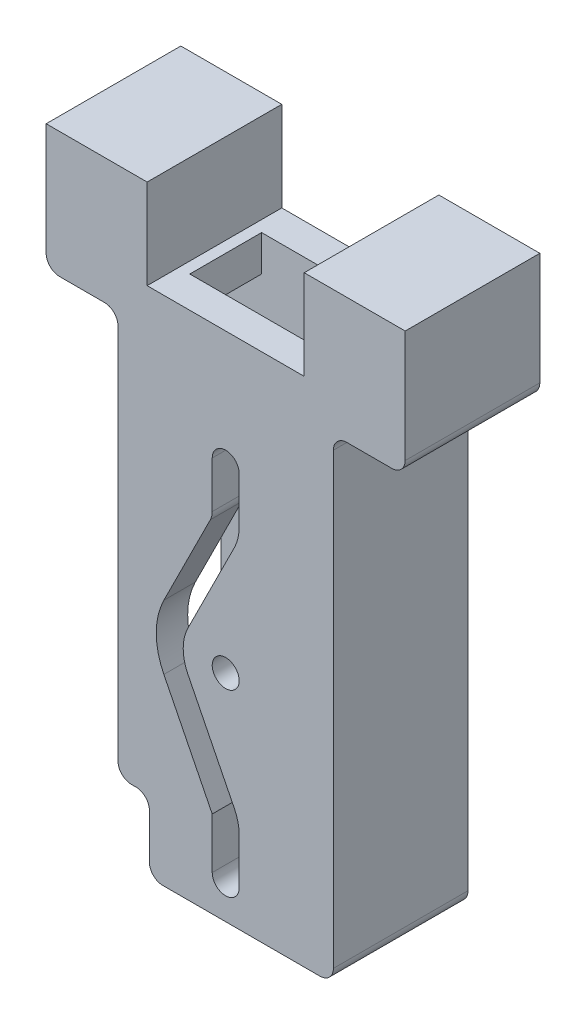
ISO-10303-21;
HEADER;
FILE_DESCRIPTION(('STEP AP214'),'2;1');
FILE_NAME('part.step','',(''),(''),'','','');
FILE_SCHEMA(('AUTOMOTIVE_DESIGN { 1 0 10303 214 1 1 1 1 }'));
ENDSEC;
DATA;
#1=APPLICATION_CONTEXT('core data for automotive mechanical design processes');
#2=APPLICATION_PROTOCOL_DEFINITION('international standard','automotive_design',2000,#1);
#3=PRODUCT_CONTEXT('',#1,'mechanical');
#4=PRODUCT('Part','Part','',(#3));
#5=PRODUCT_RELATED_PRODUCT_CATEGORY('part','',(#4));
#6=PRODUCT_DEFINITION_FORMATION('','',#4);
#7=PRODUCT_DEFINITION_CONTEXT('part definition',#1,'design');
#8=PRODUCT_DEFINITION('design','',#6,#7);
#9=PRODUCT_DEFINITION_SHAPE('','',#8);
#10=(LENGTH_UNIT() NAMED_UNIT(*) SI_UNIT(.MILLI.,.METRE.));
#11=(NAMED_UNIT(*) PLANE_ANGLE_UNIT() SI_UNIT($,.RADIAN.));
#12=(NAMED_UNIT(*) SI_UNIT($,.STERADIAN.) SOLID_ANGLE_UNIT());
#13=UNCERTAINTY_MEASURE_WITH_UNIT(LENGTH_MEASURE(1.E-05),#10,'distance_accuracy_value','');
#14=(GEOMETRIC_REPRESENTATION_CONTEXT(3) GLOBAL_UNCERTAINTY_ASSIGNED_CONTEXT((#13)) GLOBAL_UNIT_ASSIGNED_CONTEXT((#10,
#11,#12)) REPRESENTATION_CONTEXT('',''));
#15=CARTESIAN_POINT('',(0.,0.,0.));
#16=DIRECTION('',(0.,0.,1.));
#17=DIRECTION('',(1.,0.,0.));
#18=AXIS2_PLACEMENT_3D('',#15,#16,#17);
#19=CARTESIAN_POINT('',(-24.,106.,30.));
#20=DIRECTION('',(1.,0.,0.));
#21=DIRECTION('',(0.,1.,0.));
#22=AXIS2_PLACEMENT_3D('',#19,#20,#21);
#23=PLANE('',#22);
#24=DIRECTION('',(0.,0.,-1.));
#25=VECTOR('',#24,1.);
#26=CARTESIAN_POINT('',(-24.,103.,0.));
#27=LINE('',#26,#25);
#28=CARTESIAN_POINT('',(-24.,103.,30.));
#29=VERTEX_POINT('',#28);
#30=CARTESIAN_POINT('',(-24.,103.,23.));
#31=VERTEX_POINT('',#30);
#32=EDGE_CURVE('E871',#29,#31,#27,.T.);
#33=ORIENTED_EDGE('',*,*,#32,.T.);
#34=DIRECTION('',(0.,1.,0.));
#35=VECTOR('',#34,1.);
#36=CARTESIAN_POINT('',(-24.,106.,23.));
#37=LINE('',#36,#35);
#38=CARTESIAN_POINT('',(-24.,19.,23.));
#39=VERTEX_POINT('',#38);
#40=EDGE_CURVE('E684',#39,#31,#37,.T.);
#41=ORIENTED_EDGE('',*,*,#40,.F.);
#42=DIRECTION('',(0.,0.,-1.));
#43=VECTOR('',#42,1.);
#44=CARTESIAN_POINT('',(-24.,19.,30.));
#45=LINE('',#44,#43);
#46=CARTESIAN_POINT('',(-24.,19.,30.));
#47=VERTEX_POINT('',#46);
#48=EDGE_CURVE('E874',#39,#47,#45,.F.);
#49=ORIENTED_EDGE('',*,*,#48,.T.);
#50=DIRECTION('',(0.,-1.,0.));
#51=VECTOR('',#50,1.);
#52=CARTESIAN_POINT('',(-24.,106.,30.));
#53=LINE('',#52,#51);
#54=EDGE_CURVE('E802',#29,#47,#53,.T.);
#55=ORIENTED_EDGE('',*,*,#54,.F.);
#56=EDGE_LOOP('',(#33,#41,#49,#55));
#57=FACE_BOUND('',#56,.T.);
#58=ADVANCED_FACE('F26',(#57),#23,.F.);
#59=CARTESIAN_POINT('',(-24.,16.,30.));
#60=DIRECTION('',(0.,1.,0.));
#61=DIRECTION('',(0.,0.,1.));
#62=AXIS2_PLACEMENT_3D('',#59,#60,#61);
#63=PLANE('',#62);
#64=DIRECTION('',(0.,0.,-1.));
#65=VECTOR('',#64,1.);
#66=CARTESIAN_POINT('',(-21.,16.,30.));
#67=LINE('',#66,#65);
#68=CARTESIAN_POINT('',(-21.,16.,30.));
#69=VERTEX_POINT('',#68);
#70=CARTESIAN_POINT('',(-21.,16.,23.));
#71=VERTEX_POINT('',#70);
#72=EDGE_CURVE('E863',#69,#71,#67,.T.);
#73=ORIENTED_EDGE('',*,*,#72,.T.);
#74=DIRECTION('',(1.,0.,0.));
#75=VECTOR('',#74,1.);
#76=CARTESIAN_POINT('',(-24.,16.,23.));
#77=LINE('',#76,#75);
#78=CARTESIAN_POINT('',(-20.,16.,23.));
#79=VERTEX_POINT('',#78);
#80=EDGE_CURVE('E717',#71,#79,#77,.T.);
#81=ORIENTED_EDGE('',*,*,#80,.T.);
#82=DIRECTION('',(0.,0.,-1.));
#83=VECTOR('',#82,1.);
#84=CARTESIAN_POINT('',(-20.,16.,30.));
#85=LINE('',#84,#83);
#86=CARTESIAN_POINT('',(-20.,16.,30.));
#87=VERTEX_POINT('',#86);
#88=EDGE_CURVE('E866',#79,#87,#85,.F.);
#89=ORIENTED_EDGE('',*,*,#88,.T.);
#90=DIRECTION('',(1.,0.,0.));
#91=VECTOR('',#90,1.);
#92=CARTESIAN_POINT('',(-24.,16.,30.));
#93=LINE('',#92,#91);
#94=EDGE_CURVE('E805',#69,#87,#93,.T.);
#95=ORIENTED_EDGE('',*,*,#94,.F.);
#96=EDGE_LOOP('',(#73,#81,#89,#95));
#97=FACE_BOUND('',#96,.T.);
#98=ADVANCED_FACE('F1009',(#97),#63,.F.);
#99=CARTESIAN_POINT('',(-20.,13.,30.));
#100=DIRECTION('',(0.,0.,1.));
#101=DIRECTION('',(1.,0.,0.));
#102=AXIS2_PLACEMENT_3D('',#99,#100,#101);
#103=CYLINDRICAL_SURFACE('',#102,3.);
#104=ORIENTED_EDGE('',*,*,#88,.F.);
#105=CARTESIAN_POINT('',(-20.,13.,23.));
#106=DIRECTION('',(0.,0.,1.));
#107=DIRECTION('',(0.,-1.,0.));
#108=AXIS2_PLACEMENT_3D('',#105,#106,#107);
#109=CIRCLE('',#108,3.);
#110=CARTESIAN_POINT('',(-17.,13.,23.));
#111=VERTEX_POINT('',#110);
#112=EDGE_CURVE('E720',#79,#111,#109,.F.);
#113=ORIENTED_EDGE('',*,*,#112,.T.);
#114=DIRECTION('',(0.,0.,-1.));
#115=VECTOR('',#114,1.);
#116=CARTESIAN_POINT('',(-17.,13.,0.));
#117=LINE('',#116,#115);
#118=CARTESIAN_POINT('',(-17.,13.,30.));
#119=VERTEX_POINT('',#118);
#120=EDGE_CURVE('E857',#119,#111,#117,.T.);
#121=ORIENTED_EDGE('',*,*,#120,.F.);
#122=CARTESIAN_POINT('',(-20.,13.,30.));
#123=DIRECTION('',(0.,0.,1.));
#124=DIRECTION('',(1.,0.,0.));
#125=AXIS2_PLACEMENT_3D('',#122,#123,#124);
#126=CIRCLE('',#125,3.);
#127=EDGE_CURVE('E892',#87,#119,#126,.F.);
#128=ORIENTED_EDGE('',*,*,#127,.F.);
#129=EDGE_LOOP('',(#104,#113,#121,#128));
#130=FACE_BOUND('',#129,.T.);
#131=ADVANCED_FACE('F1016',(#130),#103,.F.);
#132=CARTESIAN_POINT('',(-21.,19.,30.));
#133=DIRECTION('',(0.,0.,-1.));
#134=DIRECTION('',(-1.,0.,0.));
#135=AXIS2_PLACEMENT_3D('',#132,#133,#134);
#136=CYLINDRICAL_SURFACE('',#135,3.);
#137=CARTESIAN_POINT('',(-21.,19.,23.));
#138=DIRECTION('',(0.,0.,1.));
#139=DIRECTION('',(0.,-1.,0.));
#140=AXIS2_PLACEMENT_3D('',#137,#138,#139);
#141=CIRCLE('',#140,3.);
#142=EDGE_CURVE('E715',#71,#39,#141,.F.);
#143=ORIENTED_EDGE('',*,*,#142,.F.);
#144=ORIENTED_EDGE('',*,*,#72,.F.);
#145=CARTESIAN_POINT('',(-21.,19.,30.));
#146=DIRECTION('',(0.,0.,1.));
#147=DIRECTION('',(1.,0.,0.));
#148=AXIS2_PLACEMENT_3D('',#145,#146,#147);
#149=CIRCLE('',#148,3.);
#150=EDGE_CURVE('E837',#47,#69,#149,.T.);
#151=ORIENTED_EDGE('',*,*,#150,.F.);
#152=ORIENTED_EDGE('',*,*,#48,.F.);
#153=EDGE_LOOP('',(#143,#144,#151,#152));
#154=FACE_BOUND('',#153,.T.);
#155=ADVANCED_FACE('F1166',(#154),#136,.T.);
#156=CARTESIAN_POINT('',(40.,134.,30.));
#157=DIRECTION('',(0.,-1.,0.));
#158=DIRECTION('',(0.,0.,-1.));
#159=AXIS2_PLACEMENT_3D('',#156,#157,#158);
#160=PLANE('',#159);
#161=DIRECTION('',(-1.,0.,0.));
#162=VECTOR('',#161,1.);
#163=CARTESIAN_POINT('',(40.,134.,0.));
#164=LINE('',#163,#162);
#165=CARTESIAN_POINT('',(40.,134.,0.));
#166=VERTEX_POINT('',#165);
#167=CARTESIAN_POINT('',(17.5,134.,0.));
#168=VERTEX_POINT('',#167);
#169=EDGE_CURVE('E763',#166,#168,#164,.T.);
#170=ORIENTED_EDGE('',*,*,#169,.T.);
#171=DIRECTION('',(0.,0.,-1.));
#172=VECTOR('',#171,1.);
#173=CARTESIAN_POINT('',(17.5,134.,0.));
#174=LINE('',#173,#172);
#175=CARTESIAN_POINT('',(17.5,134.,30.));
#176=VERTEX_POINT('',#175);
#177=EDGE_CURVE('E726',#176,#168,#174,.T.);
#178=ORIENTED_EDGE('',*,*,#177,.F.);
#179=DIRECTION('',(-1.,0.,0.));
#180=VECTOR('',#179,1.);
#181=CARTESIAN_POINT('',(40.,134.,30.));
#182=LINE('',#181,#180);
#183=CARTESIAN_POINT('',(40.,134.,30.));
#184=VERTEX_POINT('',#183);
#185=EDGE_CURVE('E793',#184,#176,#182,.T.);
#186=ORIENTED_EDGE('',*,*,#185,.F.);
#187=DIRECTION('',(0.,0.,-1.));
#188=VECTOR('',#187,1.);
#189=CARTESIAN_POINT('',(40.,134.,30.));
#190=LINE('',#189,#188);
#191=EDGE_CURVE('E814',#184,#166,#190,.T.);
#192=ORIENTED_EDGE('',*,*,#191,.T.);
#193=EDGE_LOOP('',(#170,#178,#186,#192));
#194=FACE_BOUND('',#193,.T.);
#195=ADVANCED_FACE('F1135',(#194),#160,.F.);
#196=CARTESIAN_POINT('',(0.,0.,30.));
#197=DIRECTION('',(0.,1.,0.));
#198=DIRECTION('',(0.,0.,1.));
#199=AXIS2_PLACEMENT_3D('',#196,#197,#198);
#200=PLANE('',#199);
#201=DIRECTION('',(0.,0.,-1.));
#202=VECTOR('',#201,1.);
#203=CARTESIAN_POINT('',(-14.,0.,30.));
#204=LINE('',#203,#202);
#205=CARTESIAN_POINT('',(-14.,0.,30.));
#206=VERTEX_POINT('',#205);
#207=CARTESIAN_POINT('',(-14.,0.,23.));
#208=VERTEX_POINT('',#207);
#209=EDGE_CURVE('E851',#206,#208,#204,.T.);
#210=ORIENTED_EDGE('',*,*,#209,.T.);
#211=DIRECTION('',(1.,0.,0.));
#212=VECTOR('',#211,1.);
#213=CARTESIAN_POINT('',(15.,0.,23.));
#214=LINE('',#213,#212);
#215=CARTESIAN_POINT('',(15.,0.,23.));
#216=VERTEX_POINT('',#215);
#217=EDGE_CURVE('E648',#208,#216,#214,.T.);
#218=ORIENTED_EDGE('',*,*,#217,.T.);
#219=DIRECTION('',(0.,0.,-1.));
#220=VECTOR('',#219,1.);
#221=CARTESIAN_POINT('',(15.,0.,7.));
#222=LINE('',#221,#220);
#223=CARTESIAN_POINT('',(15.,0.,7.));
#224=VERTEX_POINT('',#223);
#225=EDGE_CURVE('E642',#216,#224,#222,.T.);
#226=ORIENTED_EDGE('',*,*,#225,.T.);
#227=DIRECTION('',(-1.,0.,0.));
#228=VECTOR('',#227,1.);
#229=CARTESIAN_POINT('',(15.,0.,7.));
#230=LINE('',#229,#228);
#231=CARTESIAN_POINT('',(-14.,0.,7.));
#232=VERTEX_POINT('',#231);
#233=EDGE_CURVE('E645',#224,#232,#230,.T.);
#234=ORIENTED_EDGE('',*,*,#233,.T.);
#235=CARTESIAN_POINT('',(-14.,0.,0.));
#236=VERTEX_POINT('',#235);
#237=EDGE_CURVE('E850',#232,#236,#204,.T.);
#238=ORIENTED_EDGE('',*,*,#237,.T.);
#239=DIRECTION('',(1.,0.,0.));
#240=VECTOR('',#239,1.);
#241=CARTESIAN_POINT('',(0.,0.,0.));
#242=LINE('',#241,#240);
#243=CARTESIAN_POINT('',(21.,0.,0.));
#244=VERTEX_POINT('',#243);
#245=EDGE_CURVE('E744',#236,#244,#242,.T.);
#246=ORIENTED_EDGE('',*,*,#245,.T.);
#247=DIRECTION('',(0.,0.,-1.));
#248=VECTOR('',#247,1.);
#249=CARTESIAN_POINT('',(21.,0.,30.));
#250=LINE('',#249,#248);
#251=CARTESIAN_POINT('',(21.,0.,30.));
#252=VERTEX_POINT('',#251);
#253=EDGE_CURVE('E854',#244,#252,#250,.F.);
#254=ORIENTED_EDGE('',*,*,#253,.T.);
#255=DIRECTION('',(1.,0.,0.));
#256=VECTOR('',#255,1.);
#257=CARTESIAN_POINT('',(-17.,0.,30.));
#258=LINE('',#257,#256);
#259=EDGE_CURVE('E781',#206,#252,#258,.T.);
#260=ORIENTED_EDGE('',*,*,#259,.F.);
#261=EDGE_LOOP('',(#210,#218,#226,#234,#238,#246,#254,#260));
#262=FACE_BOUND('',#261,.T.);
#263=ADVANCED_FACE('F28',(#262),#200,.F.);
#264=CARTESIAN_POINT('',(24.,0.,30.));
#265=DIRECTION('',(-1.,0.,0.));
#266=DIRECTION('',(0.,-1.,0.));
#267=AXIS2_PLACEMENT_3D('',#264,#265,#266);
#268=PLANE('',#267);
#269=DIRECTION('',(0.,1.,0.));
#270=VECTOR('',#269,1.);
#271=CARTESIAN_POINT('',(24.,0.,0.));
#272=LINE('',#271,#270);
#273=CARTESIAN_POINT('',(24.,3.,0.));
#274=VERTEX_POINT('',#273);
#275=CARTESIAN_POINT('',(24.,103.,0.));
#276=VERTEX_POINT('',#275);
#277=EDGE_CURVE('E754',#274,#276,#272,.T.);
#278=ORIENTED_EDGE('',*,*,#277,.T.);
#279=DIRECTION('',(0.,0.,-1.));
#280=VECTOR('',#279,1.);
#281=CARTESIAN_POINT('',(24.,103.,30.));
#282=LINE('',#281,#280);
#283=CARTESIAN_POINT('',(24.,103.,30.));
#284=VERTEX_POINT('',#283);
#285=EDGE_CURVE('E848',#276,#284,#282,.F.);
#286=ORIENTED_EDGE('',*,*,#285,.T.);
#287=DIRECTION('',(0.,1.,0.));
#288=VECTOR('',#287,1.);
#289=CARTESIAN_POINT('',(24.,0.,30.));
#290=LINE('',#289,#288);
#291=CARTESIAN_POINT('',(24.,3.,30.));
#292=VERTEX_POINT('',#291);
#293=EDGE_CURVE('E784',#292,#284,#290,.T.);
#294=ORIENTED_EDGE('',*,*,#293,.F.);
#295=DIRECTION('',(0.,0.,-1.));
#296=VECTOR('',#295,1.);
#297=CARTESIAN_POINT('',(24.,3.,30.));
#298=LINE('',#297,#296);
#299=EDGE_CURVE('E845',#292,#274,#298,.T.);
#300=ORIENTED_EDGE('',*,*,#299,.T.);
#301=EDGE_LOOP('',(#278,#286,#294,#300));
#302=FACE_BOUND('',#301,.T.);
#303=ADVANCED_FACE('F1111',(#302),#268,.F.);
#304=CARTESIAN_POINT('',(24.,106.,30.));
#305=DIRECTION('',(0.,1.,0.));
#306=DIRECTION('',(-1.,0.,0.));
#307=AXIS2_PLACEMENT_3D('',#304,#305,#306);
#308=PLANE('',#307);
#309=DIRECTION('',(1.,0.,0.));
#310=VECTOR('',#309,1.);
#311=CARTESIAN_POINT('',(24.,106.,0.));
#312=LINE('',#311,#310);
#313=CARTESIAN_POINT('',(27.,106.,0.));
#314=VERTEX_POINT('',#313);
#315=CARTESIAN_POINT('',(37.,106.,0.));
#316=VERTEX_POINT('',#315);
#317=EDGE_CURVE('E757',#314,#316,#312,.T.);
#318=ORIENTED_EDGE('',*,*,#317,.T.);
#319=DIRECTION('',(0.,0.,-1.));
#320=VECTOR('',#319,1.);
#321=CARTESIAN_POINT('',(37.,106.,30.));
#322=LINE('',#321,#320);
#323=CARTESIAN_POINT('',(37.,106.,30.));
#324=VERTEX_POINT('',#323);
#325=EDGE_CURVE('E833',#316,#324,#322,.F.);
#326=ORIENTED_EDGE('',*,*,#325,.T.);
#327=DIRECTION('',(1.,0.,0.));
#328=VECTOR('',#327,1.);
#329=CARTESIAN_POINT('',(24.,106.,30.));
#330=LINE('',#329,#328);
#331=CARTESIAN_POINT('',(27.,106.,30.));
#332=VERTEX_POINT('',#331);
#333=EDGE_CURVE('E787',#332,#324,#330,.T.);
#334=ORIENTED_EDGE('',*,*,#333,.F.);
#335=DIRECTION('',(0.,0.,-1.));
#336=VECTOR('',#335,1.);
#337=CARTESIAN_POINT('',(27.,106.,0.));
#338=LINE('',#337,#336);
#339=EDGE_CURVE('E830',#332,#314,#338,.T.);
#340=ORIENTED_EDGE('',*,*,#339,.T.);
#341=EDGE_LOOP('',(#318,#326,#334,#340));
#342=FACE_BOUND('',#341,.T.);
#343=ADVANCED_FACE('F1120',(#342),#308,.F.);
#344=CARTESIAN_POINT('',(40.,106.,30.));
#345=DIRECTION('',(-1.,0.,0.));
#346=DIRECTION('',(0.,0.,1.));
#347=AXIS2_PLACEMENT_3D('',#344,#345,#346);
#348=PLANE('',#347);
#349=DIRECTION('',(0.,1.,0.));
#350=VECTOR('',#349,1.);
#351=CARTESIAN_POINT('',(40.,106.,30.));
#352=LINE('',#351,#350);
#353=CARTESIAN_POINT('',(40.,109.,30.));
#354=VERTEX_POINT('',#353);
#355=EDGE_CURVE('E790',#354,#184,#352,.T.);
#356=ORIENTED_EDGE('',*,*,#355,.F.);
#357=DIRECTION('',(0.,0.,-1.));
#358=VECTOR('',#357,1.);
#359=CARTESIAN_POINT('',(40.,109.,30.));
#360=LINE('',#359,#358);
#361=CARTESIAN_POINT('',(40.,109.,0.));
#362=VERTEX_POINT('',#361);
#363=EDGE_CURVE('E817',#354,#362,#360,.T.);
#364=ORIENTED_EDGE('',*,*,#363,.T.);
#365=DIRECTION('',(0.,1.,0.));
#366=VECTOR('',#365,1.);
#367=CARTESIAN_POINT('',(40.,106.,0.));
#368=LINE('',#367,#366);
#369=EDGE_CURVE('E760',#362,#166,#368,.T.);
#370=ORIENTED_EDGE('',*,*,#369,.T.);
#371=ORIENTED_EDGE('',*,*,#191,.F.);
#372=EDGE_LOOP('',(#356,#364,#370,#371));
#373=FACE_BOUND('',#372,.T.);
#374=ADVANCED_FACE('F1129',(#373),#348,.F.);
#375=CARTESIAN_POINT('',(-17.5,134.,30.));
#376=VERTEX_POINT('',#375);
#377=CARTESIAN_POINT('',(-40.,134.,30.));
#378=VERTEX_POINT('',#377);
#379=EDGE_CURVE('E792',#376,#378,#182,.T.);
#380=ORIENTED_EDGE('',*,*,#379,.F.);
#381=DIRECTION('',(0.,0.,1.));
#382=VECTOR('',#381,1.);
#383=CARTESIAN_POINT('',(-17.5,134.,0.));
#384=LINE('',#383,#382);
#385=CARTESIAN_POINT('',(-17.5,134.,0.));
#386=VERTEX_POINT('',#385);
#387=EDGE_CURVE('E728',#386,#376,#384,.T.);
#388=ORIENTED_EDGE('',*,*,#387,.F.);
#389=CARTESIAN_POINT('',(-40.,134.,0.));
#390=VERTEX_POINT('',#389);
#391=EDGE_CURVE('E762',#386,#390,#164,.T.);
#392=ORIENTED_EDGE('',*,*,#391,.T.);
#393=DIRECTION('',(0.,0.,-1.));
#394=VECTOR('',#393,1.);
#395=CARTESIAN_POINT('',(-40.,134.,30.));
#396=LINE('',#395,#394);
#397=EDGE_CURVE('E811',#378,#390,#396,.T.);
#398=ORIENTED_EDGE('',*,*,#397,.F.);
#399=EDGE_LOOP('',(#380,#388,#392,#398));
#400=FACE_BOUND('',#399,.T.);
#401=ADVANCED_FACE('F1147',(#400),#160,.F.);
#402=CARTESIAN_POINT('',(-40.,134.,30.));
#403=DIRECTION('',(1.,0.,0.));
#404=DIRECTION('',(0.,0.,-1.));
#405=AXIS2_PLACEMENT_3D('',#402,#403,#404);
#406=PLANE('',#405);
#407=DIRECTION('',(0.,-1.,0.));
#408=VECTOR('',#407,1.);
#409=CARTESIAN_POINT('',(-40.,134.,0.));
#410=LINE('',#409,#408);
#411=CARTESIAN_POINT('',(-40.,109.,0.));
#412=VERTEX_POINT('',#411);
#413=EDGE_CURVE('E766',#390,#412,#410,.T.);
#414=ORIENTED_EDGE('',*,*,#413,.T.);
#415=DIRECTION('',(0.,0.,-1.));
#416=VECTOR('',#415,1.);
#417=CARTESIAN_POINT('',(-40.,109.,30.));
#418=LINE('',#417,#416);
#419=CARTESIAN_POINT('',(-40.,109.,30.));
#420=VERTEX_POINT('',#419);
#421=EDGE_CURVE('E884',#412,#420,#418,.F.);
#422=ORIENTED_EDGE('',*,*,#421,.T.);
#423=DIRECTION('',(0.,-1.,0.));
#424=VECTOR('',#423,1.);
#425=CARTESIAN_POINT('',(-40.,134.,30.));
#426=LINE('',#425,#424);
#427=EDGE_CURVE('E796',#378,#420,#426,.T.);
#428=ORIENTED_EDGE('',*,*,#427,.F.);
#429=ORIENTED_EDGE('',*,*,#397,.T.);
#430=EDGE_LOOP('',(#414,#422,#428,#429));
#431=FACE_BOUND('',#430,.T.);
#432=ADVANCED_FACE('F1030',(#431),#406,.F.);
#433=CARTESIAN_POINT('',(-40.,106.,30.));
#434=DIRECTION('',(0.,1.,0.));
#435=DIRECTION('',(-1.,0.,0.));
#436=AXIS2_PLACEMENT_3D('',#433,#434,#435);
#437=PLANE('',#436);
#438=DIRECTION('',(1.,0.,0.));
#439=VECTOR('',#438,1.);
#440=CARTESIAN_POINT('',(-40.,106.,0.));
#441=LINE('',#440,#439);
#442=CARTESIAN_POINT('',(-37.,106.,0.));
#443=VERTEX_POINT('',#442);
#444=CARTESIAN_POINT('',(-27.,106.,0.));
#445=VERTEX_POINT('',#444);
#446=EDGE_CURVE('E769',#443,#445,#441,.T.);
#447=ORIENTED_EDGE('',*,*,#446,.T.);
#448=DIRECTION('',(0.,0.,-1.));
#449=VECTOR('',#448,1.);
#450=CARTESIAN_POINT('',(-27.,106.,30.0000000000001));
#451=LINE('',#450,#449);
#452=CARTESIAN_POINT('',(-27.,106.,30.0000000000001));
#453=VERTEX_POINT('',#452);
#454=EDGE_CURVE('E882',#445,#453,#451,.F.);
#455=ORIENTED_EDGE('',*,*,#454,.T.);
#456=DIRECTION('',(1.,0.,0.));
#457=VECTOR('',#456,1.);
#458=CARTESIAN_POINT('',(-40.,106.,30.));
#459=LINE('',#458,#457);
#460=CARTESIAN_POINT('',(-37.,106.,30.));
#461=VERTEX_POINT('',#460);
#462=EDGE_CURVE('E799',#461,#453,#459,.T.);
#463=ORIENTED_EDGE('',*,*,#462,.F.);
#464=DIRECTION('',(0.,0.,-1.));
#465=VECTOR('',#464,1.);
#466=CARTESIAN_POINT('',(-37.,106.,30.));
#467=LINE('',#466,#465);
#468=EDGE_CURVE('E879',#461,#443,#467,.T.);
#469=ORIENTED_EDGE('',*,*,#468,.T.);
#470=EDGE_LOOP('',(#447,#455,#463,#469));
#471=FACE_BOUND('',#470,.T.);
#472=ADVANCED_FACE('F1022',(#471),#437,.F.);
#473=CARTESIAN_POINT('',(-24.,19.,0.));
#474=VERTEX_POINT('',#473);
#475=CARTESIAN_POINT('',(-24.,19.,7.00000000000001));
#476=VERTEX_POINT('',#475);
#477=EDGE_CURVE('E876',#474,#476,#45,.F.);
#478=ORIENTED_EDGE('',*,*,#477,.T.);
#479=DIRECTION('',(0.,-1.,0.));
#480=VECTOR('',#479,1.);
#481=CARTESIAN_POINT('',(-24.,106.,7.));
#482=LINE('',#481,#480);
#483=CARTESIAN_POINT('',(-24.,103.,7.));
#484=VERTEX_POINT('',#483);
#485=EDGE_CURVE('E688',#484,#476,#482,.T.);
#486=ORIENTED_EDGE('',*,*,#485,.F.);
#487=CARTESIAN_POINT('',(-24.,103.,0.));
#488=VERTEX_POINT('',#487);
#489=EDGE_CURVE('E870',#484,#488,#27,.T.);
#490=ORIENTED_EDGE('',*,*,#489,.T.);
#491=DIRECTION('',(0.,-1.,0.));
#492=VECTOR('',#491,1.);
#493=CARTESIAN_POINT('',(-24.,106.,0.));
#494=LINE('',#493,#492);
#495=EDGE_CURVE('E772',#488,#474,#494,.T.);
#496=ORIENTED_EDGE('',*,*,#495,.T.);
#497=EDGE_LOOP('',(#478,#486,#490,#496));
#498=FACE_BOUND('',#497,.T.);
#499=ADVANCED_FACE('F1012',(#498),#23,.F.);
#500=CARTESIAN_POINT('',(-20.,16.,0.));
#501=VERTEX_POINT('',#500);
#502=CARTESIAN_POINT('',(-20.,16.,7.00000000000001));
#503=VERTEX_POINT('',#502);
#504=EDGE_CURVE('E867',#501,#503,#85,.F.);
#505=ORIENTED_EDGE('',*,*,#504,.T.);
#506=DIRECTION('',(-1.,0.,0.));
#507=VECTOR('',#506,1.);
#508=CARTESIAN_POINT('',(-24.,16.,7.00000000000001));
#509=LINE('',#508,#507);
#510=CARTESIAN_POINT('',(-21.,16.,7.00000000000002));
#511=VERTEX_POINT('',#510);
#512=EDGE_CURVE('E706',#503,#511,#509,.T.);
#513=ORIENTED_EDGE('',*,*,#512,.T.);
#514=CARTESIAN_POINT('',(-21.,16.,0.));
#515=VERTEX_POINT('',#514);
#516=EDGE_CURVE('E862',#511,#515,#67,.T.);
#517=ORIENTED_EDGE('',*,*,#516,.T.);
#518=DIRECTION('',(1.,0.,0.));
#519=VECTOR('',#518,1.);
#520=CARTESIAN_POINT('',(-24.,16.,0.));
#521=LINE('',#520,#519);
#522=EDGE_CURVE('E775',#515,#501,#521,.T.);
#523=ORIENTED_EDGE('',*,*,#522,.T.);
#524=EDGE_LOOP('',(#505,#513,#517,#523));
#525=FACE_BOUND('',#524,.T.);
#526=ADVANCED_FACE('F1019',(#525),#63,.F.);
#527=CARTESIAN_POINT('',(-17.,16.,30.));
#528=DIRECTION('',(1.,0.,0.));
#529=DIRECTION('',(0.,1.,0.));
#530=AXIS2_PLACEMENT_3D('',#527,#528,#529);
#531=PLANE('',#530);
#532=ORIENTED_EDGE('',*,*,#120,.T.);
#533=DIRECTION('',(0.,-1.,0.));
#534=VECTOR('',#533,1.);
#535=CARTESIAN_POINT('',(-17.,16.,23.));
#536=LINE('',#535,#534);
#537=CARTESIAN_POINT('',(-17.,8.00000000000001,23.));
#538=VERTEX_POINT('',#537);
#539=EDGE_CURVE('E723',#111,#538,#536,.T.);
#540=ORIENTED_EDGE('',*,*,#539,.T.);
#541=DIRECTION('',(0.,0.,-1.));
#542=VECTOR('',#541,1.);
#543=CARTESIAN_POINT('',(-17.,8.00000000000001,30.));
#544=LINE('',#543,#542);
#545=CARTESIAN_POINT('',(-17.,8.00000000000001,7.00000000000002));
#546=VERTEX_POINT('',#545);
#547=EDGE_CURVE('E898',#538,#546,#544,.T.);
#548=ORIENTED_EDGE('',*,*,#547,.T.);
#549=DIRECTION('',(0.,1.,0.));
#550=VECTOR('',#549,1.);
#551=CARTESIAN_POINT('',(-17.,16.,7.00000000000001));
#552=LINE('',#551,#550);
#553=CARTESIAN_POINT('',(-17.,13.,7.00000000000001));
#554=VERTEX_POINT('',#553);
#555=EDGE_CURVE('E712',#546,#554,#552,.T.);
#556=ORIENTED_EDGE('',*,*,#555,.T.);
#557=CARTESIAN_POINT('',(-17.,13.,0.));
#558=VERTEX_POINT('',#557);
#559=EDGE_CURVE('E856',#554,#558,#117,.T.);
#560=ORIENTED_EDGE('',*,*,#559,.T.);
#561=DIRECTION('',(0.,-1.,0.));
#562=VECTOR('',#561,1.);
#563=CARTESIAN_POINT('',(-17.,16.,0.));
#564=LINE('',#563,#562);
#565=CARTESIAN_POINT('',(-17.,3.,0.));
#566=VERTEX_POINT('',#565);
#567=EDGE_CURVE('E778',#558,#566,#564,.T.);
#568=ORIENTED_EDGE('',*,*,#567,.T.);
#569=DIRECTION('',(0.,0.,-1.));
#570=VECTOR('',#569,1.);
#571=CARTESIAN_POINT('',(-17.,3.,30.));
#572=LINE('',#571,#570);
#573=CARTESIAN_POINT('',(-17.,3.,30.));
#574=VERTEX_POINT('',#573);
#575=EDGE_CURVE('E860',#566,#574,#572,.F.);
#576=ORIENTED_EDGE('',*,*,#575,.T.);
#577=DIRECTION('',(0.,-1.,0.));
#578=VECTOR('',#577,1.);
#579=CARTESIAN_POINT('',(-17.,16.,30.));
#580=LINE('',#579,#578);
#581=EDGE_CURVE('E808',#119,#574,#580,.T.);
#582=ORIENTED_EDGE('',*,*,#581,.F.);
#583=EDGE_LOOP('',(#532,#540,#548,#556,#560,#568,#576,#582));
#584=FACE_BOUND('',#583,.T.);
#585=ADVANCED_FACE('F1028',(#584),#531,.F.);
#586=CARTESIAN_POINT('',(40.,0.,30.));
#587=DIRECTION('',(0.,0.,1.));
#588=DIRECTION('',(1.,0.,0.));
#589=AXIS2_PLACEMENT_3D('',#586,#587,#588);
#590=PLANE('',#589);
#591=CARTESIAN_POINT('',(0.,48.,30.));
#592=DIRECTION('',(0.,0.,1.));
#593=DIRECTION('',(1.,0.,0.));
#594=AXIS2_PLACEMENT_3D('',#591,#592,#593);
#595=CIRCLE('',#594,3.);
#596=CARTESIAN_POINT('',(2.99999999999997,48.,30.));
#597=VERTEX_POINT('',#596);
#598=EDGE_CURVE('E1457',#597,#597,#595,.T.);
#599=ORIENTED_EDGE('',*,*,#598,.F.);
#600=EDGE_LOOP('',(#599));
#601=FACE_BOUND('',#600,.T.);
#602=CARTESIAN_POINT('',(0.,88.,30.));
#603=DIRECTION('',(0.,0.,1.));
#604=DIRECTION('',(-1.,0.,0.));
#605=AXIS2_PLACEMENT_3D('',#602,#603,#604);
#606=CIRCLE('',#605,3.);
#607=CARTESIAN_POINT('',(2.99999999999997,88.,30.));
#608=VERTEX_POINT('',#607);
#609=CARTESIAN_POINT('',(-3.00000000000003,88.,30.));
#610=VERTEX_POINT('',#609);
#611=EDGE_CURVE('E42',#608,#610,#606,.T.);
#612=ORIENTED_EDGE('',*,*,#611,.F.);
#613=DIRECTION('',(0.,1.,0.));
#614=VECTOR('',#613,1.);
#615=CARTESIAN_POINT('',(2.99999999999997,88.,30.));
#616=LINE('',#615,#614);
#617=CARTESIAN_POINT('',(2.99999999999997,77.6524758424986,30.));
#618=VERTEX_POINT('',#617);
#619=EDGE_CURVE('E501',#618,#608,#616,.T.);
#620=ORIENTED_EDGE('',*,*,#619,.F.);
#621=CARTESIAN_POINT('',(-7.,77.6524758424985,30.));
#622=DIRECTION('',(0.,0.,1.));
#623=DIRECTION('',(-1.,0.,0.));
#624=AXIS2_PLACEMENT_3D('',#621,#622,#623);
#625=CIRCLE('',#624,10.);
#626=CARTESIAN_POINT('',(1.94427190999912,73.1803398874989,30.));
#627=VERTEX_POINT('',#626);
#628=EDGE_CURVE('E498',#627,#618,#625,.T.);
#629=ORIENTED_EDGE('',*,*,#628,.F.);
#630=DIRECTION('',(0.447213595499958,0.894427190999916,0.));
#631=VECTOR('',#630,1.);
#632=CARTESIAN_POINT('',(1.94427190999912,73.1803398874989,30.));
#633=LINE('',#632,#631);
#634=CARTESIAN_POINT('',(-8.40983005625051,52.4721359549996,30.));
#635=VERTEX_POINT('',#634);
#636=EDGE_CURVE('E495',#635,#627,#633,.T.);
#637=ORIENTED_EDGE('',*,*,#636,.F.);
#638=CARTESIAN_POINT('',(0.534441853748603,48.,30.));
#639=DIRECTION('',(0.,0.,-1.));
#640=DIRECTION('',(1.,0.,0.));
#641=AXIS2_PLACEMENT_3D('',#638,#639,#640);
#642=CIRCLE('',#641,10.);
#643=CARTESIAN_POINT('',(-8.40983005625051,43.5278640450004,30.));
#644=VERTEX_POINT('',#643);
#645=EDGE_CURVE('E492',#644,#635,#642,.T.);
#646=ORIENTED_EDGE('',*,*,#645,.F.);
#647=DIRECTION('',(-0.447213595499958,0.894427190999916,0.));
#648=VECTOR('',#647,1.);
#649=CARTESIAN_POINT('',(-8.40983005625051,43.5278640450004,30.));
#650=LINE('',#649,#648);
#651=CARTESIAN_POINT('',(1.94427190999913,22.819660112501,30.));
#652=VERTEX_POINT('',#651);
#653=EDGE_CURVE('E489',#652,#644,#650,.T.);
#654=ORIENTED_EDGE('',*,*,#653,.F.);
#655=CARTESIAN_POINT('',(-6.99999999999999,18.3475241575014,30.));
#656=DIRECTION('',(0.,0.,1.));
#657=DIRECTION('',(1.,0.,0.));
#658=AXIS2_PLACEMENT_3D('',#655,#656,#657);
#659=CIRCLE('',#658,10.);
#660=CARTESIAN_POINT('',(2.99999999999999,18.3475241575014,30.));
#661=VERTEX_POINT('',#660);
#662=EDGE_CURVE('E486',#661,#652,#659,.T.);
#663=ORIENTED_EDGE('',*,*,#662,.F.);
#664=DIRECTION('',(0.,1.,0.));
#665=VECTOR('',#664,1.);
#666=CARTESIAN_POINT('',(2.99999999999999,18.3475241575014,30.));
#667=LINE('',#666,#665);
#668=CARTESIAN_POINT('',(2.99999999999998,7.99999999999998,30.));
#669=VERTEX_POINT('',#668);
#670=EDGE_CURVE('E483',#669,#661,#667,.T.);
#671=ORIENTED_EDGE('',*,*,#670,.F.);
#672=CARTESIAN_POINT('',(0.,7.99999999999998,30.));
#673=DIRECTION('',(0.,0.,1.));
#674=DIRECTION('',(1.,0.,0.));
#675=AXIS2_PLACEMENT_3D('',#672,#673,#674);
#676=CIRCLE('',#675,3.);
#677=CARTESIAN_POINT('',(-3.00000000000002,7.99999999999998,30.));
#678=VERTEX_POINT('',#677);
#679=EDGE_CURVE('E480',#678,#669,#676,.T.);
#680=ORIENTED_EDGE('',*,*,#679,.F.);
#681=DIRECTION('',(0.,-1.,0.));
#682=VECTOR('',#681,1.);
#683=CARTESIAN_POINT('',(-3.00000000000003,19.2917960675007,30.));
#684=LINE('',#683,#682);
#685=CARTESIAN_POINT('',(-3.00000000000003,19.2917960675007,30.));
#686=VERTEX_POINT('',#685);
#687=EDGE_CURVE('E477',#686,#678,#684,.T.);
#688=ORIENTED_EDGE('',*,*,#687,.F.);
#689=DIRECTION('',(0.447213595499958,-0.894427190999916,0.));
#690=VECTOR('',#689,1.);
#691=CARTESIAN_POINT('',(-13.77639320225,40.8445824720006,30.));
#692=LINE('',#691,#690);
#693=CARTESIAN_POINT('',(-13.77639320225,40.8445824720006,30.));
#694=VERTEX_POINT('',#693);
#695=EDGE_CURVE('E474',#694,#686,#692,.T.);
#696=ORIENTED_EDGE('',*,*,#695,.F.);
#697=CARTESIAN_POINT('',(0.534441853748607,48.,30.));
#698=DIRECTION('',(0.,0.,1.));
#699=DIRECTION('',(1.,0.,0.));
#700=AXIS2_PLACEMENT_3D('',#697,#698,#699);
#701=CIRCLE('',#700,16.);
#702=CARTESIAN_POINT('',(-13.77639320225,55.1554175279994,30.));
#703=VERTEX_POINT('',#702);
#704=EDGE_CURVE('E468',#703,#694,#701,.T.);
#705=ORIENTED_EDGE('',*,*,#704,.F.);
#706=DIRECTION('',(-0.447213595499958,-0.894427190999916,0.));
#707=VECTOR('',#706,1.);
#708=CARTESIAN_POINT('',(-3.42229123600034,75.8636214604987,30.));
#709=LINE('',#708,#707);
#710=CARTESIAN_POINT('',(-3.42229123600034,75.8636214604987,30.));
#711=VERTEX_POINT('',#710);
#712=EDGE_CURVE('E466',#711,#703,#709,.T.);
#713=ORIENTED_EDGE('',*,*,#712,.F.);
#714=CARTESIAN_POINT('',(-7.,77.6524758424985,30.));
#715=DIRECTION('',(0.,0.,-1.));
#716=DIRECTION('',(-1.,0.,0.));
#717=AXIS2_PLACEMENT_3D('',#714,#715,#716);
#718=CIRCLE('',#717,4.);
#719=CARTESIAN_POINT('',(-3.00000000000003,77.6524758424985,30.));
#720=VERTEX_POINT('',#719);
#721=EDGE_CURVE('E447',#720,#711,#718,.T.);
#722=ORIENTED_EDGE('',*,*,#721,.F.);
#723=DIRECTION('',(0.,-1.,0.));
#724=VECTOR('',#723,1.);
#725=CARTESIAN_POINT('',(-3.00000000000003,88.,30.));
#726=LINE('',#725,#724);
#727=EDGE_CURVE('E457',#610,#720,#726,.T.);
#728=ORIENTED_EDGE('',*,*,#727,.F.);
#729=EDGE_LOOP('',(#612,#620,#629,#637,#646,#654,#663,#671,#680,#688,#696,#705,#713,#722,#728));
#730=FACE_BOUND('',#729,.T.);
#731=DIRECTION('',(0.,1.,0.));
#732=VECTOR('',#731,1.);
#733=CARTESIAN_POINT('',(17.5,114.,30.));
#734=LINE('',#733,#732);
#735=CARTESIAN_POINT('',(17.5,114.,30.));
#736=VERTEX_POINT('',#735);
#737=EDGE_CURVE('E742',#736,#176,#734,.T.);
#738=ORIENTED_EDGE('',*,*,#737,.F.);
#739=DIRECTION('',(1.,0.,0.));
#740=VECTOR('',#739,1.);
#741=CARTESIAN_POINT('',(17.5,114.,30.));
#742=LINE('',#741,#740);
#743=CARTESIAN_POINT('',(-17.5,114.,30.));
#744=VERTEX_POINT('',#743);
#745=EDGE_CURVE('E738',#744,#736,#742,.T.);
#746=ORIENTED_EDGE('',*,*,#745,.F.);
#747=DIRECTION('',(0.,1.,0.));
#748=VECTOR('',#747,1.);
#749=CARTESIAN_POINT('',(-17.5,114.,30.));
#750=LINE('',#749,#748);
#751=EDGE_CURVE('E745',#744,#376,#750,.T.);
#752=ORIENTED_EDGE('',*,*,#751,.T.);
#753=ORIENTED_EDGE('',*,*,#379,.T.);
#754=ORIENTED_EDGE('',*,*,#427,.T.);
#755=CARTESIAN_POINT('',(-37.,109.,30.));
#756=DIRECTION('',(0.,0.,1.));
#757=DIRECTION('',(1.,0.,0.));
#758=AXIS2_PLACEMENT_3D('',#755,#756,#757);
#759=CIRCLE('',#758,3.);
#760=EDGE_CURVE('E835',#420,#461,#759,.T.);
#761=ORIENTED_EDGE('',*,*,#760,.T.);
#762=ORIENTED_EDGE('',*,*,#462,.T.);
#763=CARTESIAN_POINT('',(-27.,103.,30.0000000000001));
#764=DIRECTION('',(0.,0.,1.));
#765=DIRECTION('',(1.,0.,0.));
#766=AXIS2_PLACEMENT_3D('',#763,#764,#765);
#767=CIRCLE('',#766,3.);
#768=EDGE_CURVE('E896',#453,#29,#767,.F.);
#769=ORIENTED_EDGE('',*,*,#768,.T.);
#770=ORIENTED_EDGE('',*,*,#54,.T.);
#771=ORIENTED_EDGE('',*,*,#150,.T.);
#772=ORIENTED_EDGE('',*,*,#94,.T.);
#773=ORIENTED_EDGE('',*,*,#127,.T.);
#774=ORIENTED_EDGE('',*,*,#581,.T.);
#775=CARTESIAN_POINT('',(-14.,3.,30.));
#776=DIRECTION('',(0.,0.,1.));
#777=DIRECTION('',(1.,0.,0.));
#778=AXIS2_PLACEMENT_3D('',#775,#776,#777);
#779=CIRCLE('',#778,3.);
#780=EDGE_CURVE('E839',#574,#206,#779,.T.);
#781=ORIENTED_EDGE('',*,*,#780,.T.);
#782=ORIENTED_EDGE('',*,*,#259,.T.);
#783=CARTESIAN_POINT('',(21.,3.,30.));
#784=DIRECTION('',(0.,0.,1.));
#785=DIRECTION('',(1.,0.,0.));
#786=AXIS2_PLACEMENT_3D('',#783,#784,#785);
#787=CIRCLE('',#786,3.);
#788=EDGE_CURVE('E841',#252,#292,#787,.T.);
#789=ORIENTED_EDGE('',*,*,#788,.T.);
#790=ORIENTED_EDGE('',*,*,#293,.T.);
#791=CARTESIAN_POINT('',(27.,103.,30.));
#792=DIRECTION('',(0.,0.,1.));
#793=DIRECTION('',(1.,0.,0.));
#794=AXIS2_PLACEMENT_3D('',#791,#792,#793);
#795=CIRCLE('',#794,3.);
#796=EDGE_CURVE('E888',#284,#332,#795,.F.);
#797=ORIENTED_EDGE('',*,*,#796,.T.);
#798=ORIENTED_EDGE('',*,*,#333,.T.);
#799=CARTESIAN_POINT('',(37.,109.,30.));
#800=DIRECTION('',(0.,0.,1.));
#801=DIRECTION('',(1.,0.,0.));
#802=AXIS2_PLACEMENT_3D('',#799,#800,#801);
#803=CIRCLE('',#802,3.);
#804=EDGE_CURVE('E843',#324,#354,#803,.T.);
#805=ORIENTED_EDGE('',*,*,#804,.T.);
#806=ORIENTED_EDGE('',*,*,#355,.T.);
#807=ORIENTED_EDGE('',*,*,#185,.T.);
#808=EDGE_LOOP('',(#738,#746,#752,#753,#754,#761,#762,#769,#770,#771,#772,#773,#774,#781,#782,
#789,#790,#797,#798,#805,#806,#807));
#809=FACE_BOUND('',#808,.T.);
#810=ADVANCED_FACE('F462',(#601,#730,#809),#590,.T.);
#811=CARTESIAN_POINT('',(40.,0.,0.));
#812=DIRECTION('',(0.,0.,1.));
#813=DIRECTION('',(1.,0.,0.));
#814=AXIS2_PLACEMENT_3D('',#811,#812,#813);
#815=PLANE('',#814);
#816=CARTESIAN_POINT('',(0.,48.,0.));
#817=DIRECTION('',(0.,0.,1.));
#818=DIRECTION('',(1.,0.,0.));
#819=AXIS2_PLACEMENT_3D('',#816,#817,#818);
#820=CIRCLE('',#819,3.);
#821=CARTESIAN_POINT('',(3.,48.,0.));
#822=VERTEX_POINT('',#821);
#823=EDGE_CURVE('E1464',#822,#822,#820,.T.);
#824=ORIENTED_EDGE('',*,*,#823,.T.);
#825=EDGE_LOOP('',(#824));
#826=FACE_BOUND('',#825,.T.);
#827=DIRECTION('',(0.,1.,0.));
#828=VECTOR('',#827,1.);
#829=CARTESIAN_POINT('',(3.,88.,0.));
#830=LINE('',#829,#828);
#831=CARTESIAN_POINT('',(3.,77.6524758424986,0.));
#832=VERTEX_POINT('',#831);
#833=CARTESIAN_POINT('',(3.,88.,0.));
#834=VERTEX_POINT('',#833);
#835=EDGE_CURVE('E544',#832,#834,#830,.T.);
#836=ORIENTED_EDGE('',*,*,#835,.T.);
#837=CARTESIAN_POINT('',(0.,88.,0.));
#838=DIRECTION('',(0.,0.,1.));
#839=DIRECTION('',(-1.,0.,0.));
#840=AXIS2_PLACEMENT_3D('',#837,#838,#839);
#841=CIRCLE('',#840,3.);
#842=CARTESIAN_POINT('',(-3.,88.,0.));
#843=VERTEX_POINT('',#842);
#844=EDGE_CURVE('E504',#834,#843,#841,.T.);
#845=ORIENTED_EDGE('',*,*,#844,.T.);
#846=DIRECTION('',(0.,-1.,0.));
#847=VECTOR('',#846,1.);
#848=CARTESIAN_POINT('',(-3.,88.,0.));
#849=LINE('',#848,#847);
#850=CARTESIAN_POINT('',(-2.99999999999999,77.6524758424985,0.));
#851=VERTEX_POINT('',#850);
#852=EDGE_CURVE('E507',#843,#851,#849,.T.);
#853=ORIENTED_EDGE('',*,*,#852,.T.);
#854=CARTESIAN_POINT('',(-7.,77.6524758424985,0.));
#855=DIRECTION('',(0.,0.,-1.));
#856=DIRECTION('',(-1.,0.,0.));
#857=AXIS2_PLACEMENT_3D('',#854,#855,#856);
#858=CIRCLE('',#857,4.);
#859=CARTESIAN_POINT('',(-3.42229123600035,75.8636214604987,0.));
#860=VERTEX_POINT('',#859);
#861=EDGE_CURVE('E50',#851,#860,#858,.T.);
#862=ORIENTED_EDGE('',*,*,#861,.T.);
#863=DIRECTION('',(-0.447213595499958,-0.894427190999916,0.));
#864=VECTOR('',#863,1.);
#865=CARTESIAN_POINT('',(-3.42229123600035,75.8636214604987,0.));
#866=LINE('',#865,#864);
#867=CARTESIAN_POINT('',(-13.77639320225,55.1554175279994,0.));
#868=VERTEX_POINT('',#867);
#869=EDGE_CURVE('E511',#860,#868,#866,.T.);
#870=ORIENTED_EDGE('',*,*,#869,.T.);
#871=CARTESIAN_POINT('',(0.534441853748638,48.,0.));
#872=DIRECTION('',(0.,0.,1.));
#873=DIRECTION('',(1.,0.,0.));
#874=AXIS2_PLACEMENT_3D('',#871,#872,#873);
#875=CIRCLE('',#874,16.);
#876=CARTESIAN_POINT('',(-13.77639320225,40.8445824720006,0.));
#877=VERTEX_POINT('',#876);
#878=EDGE_CURVE('E514',#868,#877,#875,.T.);
#879=ORIENTED_EDGE('',*,*,#878,.T.);
#880=DIRECTION('',(0.447213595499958,-0.894427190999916,0.));
#881=VECTOR('',#880,1.);
#882=CARTESIAN_POINT('',(-13.77639320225,40.8445824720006,0.));
#883=LINE('',#882,#881);
#884=CARTESIAN_POINT('',(-3.,19.2917960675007,0.));
#885=VERTEX_POINT('',#884);
#886=EDGE_CURVE('E517',#877,#885,#883,.T.);
#887=ORIENTED_EDGE('',*,*,#886,.T.);
#888=DIRECTION('',(0.,-1.,0.));
#889=VECTOR('',#888,1.);
#890=CARTESIAN_POINT('',(-3.,19.2917960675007,0.));
#891=LINE('',#890,#889);
#892=CARTESIAN_POINT('',(-2.99999999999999,7.99999999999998,0.));
#893=VERTEX_POINT('',#892);
#894=EDGE_CURVE('E520',#885,#893,#891,.T.);
#895=ORIENTED_EDGE('',*,*,#894,.T.);
#896=CARTESIAN_POINT('',(0.,7.99999999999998,0.));
#897=DIRECTION('',(0.,0.,1.));
#898=DIRECTION('',(1.,0.,0.));
#899=AXIS2_PLACEMENT_3D('',#896,#897,#898);
#900=CIRCLE('',#899,3.);
#901=CARTESIAN_POINT('',(3.00000000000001,7.99999999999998,0.));
#902=VERTEX_POINT('',#901);
#903=EDGE_CURVE('E523',#893,#902,#900,.T.);
#904=ORIENTED_EDGE('',*,*,#903,.T.);
#905=DIRECTION('',(0.,1.,0.));
#906=VECTOR('',#905,1.);
#907=CARTESIAN_POINT('',(3.00000000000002,18.3475241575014,0.));
#908=LINE('',#907,#906);
#909=CARTESIAN_POINT('',(3.00000000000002,18.3475241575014,0.));
#910=VERTEX_POINT('',#909);
#911=EDGE_CURVE('E526',#902,#910,#908,.T.);
#912=ORIENTED_EDGE('',*,*,#911,.T.);
#913=CARTESIAN_POINT('',(-7.,18.3475241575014,0.));
#914=DIRECTION('',(0.,0.,1.));
#915=DIRECTION('',(1.,0.,0.));
#916=AXIS2_PLACEMENT_3D('',#913,#914,#915);
#917=CIRCLE('',#916,10.);
#918=CARTESIAN_POINT('',(1.94427190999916,22.819660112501,0.));
#919=VERTEX_POINT('',#918);
#920=EDGE_CURVE('E529',#910,#919,#917,.T.);
#921=ORIENTED_EDGE('',*,*,#920,.T.);
#922=DIRECTION('',(-0.447213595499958,0.894427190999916,0.));
#923=VECTOR('',#922,1.);
#924=CARTESIAN_POINT('',(-8.40983005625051,43.5278640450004,0.));
#925=LINE('',#924,#923);
#926=CARTESIAN_POINT('',(-8.40983005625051,43.5278640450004,0.));
#927=VERTEX_POINT('',#926);
#928=EDGE_CURVE('E532',#919,#927,#925,.T.);
#929=ORIENTED_EDGE('',*,*,#928,.T.);
#930=CARTESIAN_POINT('',(0.534441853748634,48.,0.));
#931=DIRECTION('',(0.,0.,-1.));
#932=DIRECTION('',(1.,0.,0.));
#933=AXIS2_PLACEMENT_3D('',#930,#931,#932);
#934=CIRCLE('',#933,10.);
#935=CARTESIAN_POINT('',(-8.40983005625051,52.4721359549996,0.));
#936=VERTEX_POINT('',#935);
#937=EDGE_CURVE('E535',#927,#936,#934,.T.);
#938=ORIENTED_EDGE('',*,*,#937,.T.);
#939=DIRECTION('',(0.447213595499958,0.894427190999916,0.));
#940=VECTOR('',#939,1.);
#941=CARTESIAN_POINT('',(1.94427190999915,73.1803398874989,0.));
#942=LINE('',#941,#940);
#943=CARTESIAN_POINT('',(1.94427190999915,73.1803398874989,0.));
#944=VERTEX_POINT('',#943);
#945=EDGE_CURVE('E538',#936,#944,#942,.T.);
#946=ORIENTED_EDGE('',*,*,#945,.T.);
#947=CARTESIAN_POINT('',(-7.,77.6524758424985,0.));
#948=DIRECTION('',(0.,0.,1.));
#949=DIRECTION('',(-1.,0.,0.));
#950=AXIS2_PLACEMENT_3D('',#947,#948,#949);
#951=CIRCLE('',#950,10.);
#952=EDGE_CURVE('E541',#944,#832,#951,.T.);
#953=ORIENTED_EDGE('',*,*,#952,.T.);
#954=EDGE_LOOP('',(#836,#845,#853,#862,#870,#879,#887,#895,#904,#912,#921,#929,#938,#946,#953));
#955=FACE_BOUND('',#954,.T.);
#956=DIRECTION('',(-1.,0.,0.));
#957=VECTOR('',#956,1.);
#958=CARTESIAN_POINT('',(17.5,114.,0.));
#959=LINE('',#958,#957);
#960=CARTESIAN_POINT('',(17.5,114.,0.));
#961=VERTEX_POINT('',#960);
#962=CARTESIAN_POINT('',(-17.5,114.,0.));
#963=VERTEX_POINT('',#962);
#964=EDGE_CURVE('E732',#961,#963,#959,.T.);
#965=ORIENTED_EDGE('',*,*,#964,.F.);
#966=DIRECTION('',(0.,1.,0.));
#967=VECTOR('',#966,1.);
#968=CARTESIAN_POINT('',(17.5,114.,0.));
#969=LINE('',#968,#967);
#970=EDGE_CURVE('E741',#961,#168,#969,.T.);
#971=ORIENTED_EDGE('',*,*,#970,.T.);
#972=ORIENTED_EDGE('',*,*,#169,.F.);
#973=ORIENTED_EDGE('',*,*,#369,.F.);
#974=CARTESIAN_POINT('',(37.,109.,0.));
#975=DIRECTION('',(0.,0.,1.));
#976=DIRECTION('',(1.,0.,0.));
#977=AXIS2_PLACEMENT_3D('',#974,#975,#976);
#978=CIRCLE('',#977,3.);
#979=EDGE_CURVE('E828',#362,#316,#978,.F.);
#980=ORIENTED_EDGE('',*,*,#979,.T.);
#981=ORIENTED_EDGE('',*,*,#317,.F.);
#982=CARTESIAN_POINT('',(27.,103.,0.));
#983=DIRECTION('',(0.,0.,1.));
#984=DIRECTION('',(1.,0.,0.));
#985=AXIS2_PLACEMENT_3D('',#982,#983,#984);
#986=CIRCLE('',#985,3.);
#987=EDGE_CURVE('E886',#314,#276,#986,.T.);
#988=ORIENTED_EDGE('',*,*,#987,.T.);
#989=ORIENTED_EDGE('',*,*,#277,.F.);
#990=CARTESIAN_POINT('',(21.,3.,0.));
#991=DIRECTION('',(0.,0.,1.));
#992=DIRECTION('',(1.,0.,0.));
#993=AXIS2_PLACEMENT_3D('',#990,#991,#992);
#994=CIRCLE('',#993,3.);
#995=EDGE_CURVE('E826',#274,#244,#994,.F.);
#996=ORIENTED_EDGE('',*,*,#995,.T.);
#997=ORIENTED_EDGE('',*,*,#245,.F.);
#998=CARTESIAN_POINT('',(-14.,3.,0.));
#999=DIRECTION('',(0.,0.,1.));
#1000=DIRECTION('',(1.,0.,0.));
#1001=AXIS2_PLACEMENT_3D('',#998,#999,#1000);
#1002=CIRCLE('',#1001,3.);
#1003=EDGE_CURVE('E824',#236,#566,#1002,.F.);
#1004=ORIENTED_EDGE('',*,*,#1003,.T.);
#1005=ORIENTED_EDGE('',*,*,#567,.F.);
#1006=CARTESIAN_POINT('',(-20.,13.,0.));
#1007=DIRECTION('',(0.,0.,1.));
#1008=DIRECTION('',(1.,0.,0.));
#1009=AXIS2_PLACEMENT_3D('',#1006,#1007,#1008);
#1010=CIRCLE('',#1009,3.);
#1011=EDGE_CURVE('E890',#558,#501,#1010,.T.);
#1012=ORIENTED_EDGE('',*,*,#1011,.T.);
#1013=ORIENTED_EDGE('',*,*,#522,.F.);
#1014=CARTESIAN_POINT('',(-21.,19.,0.));
#1015=DIRECTION('',(0.,0.,1.));
#1016=DIRECTION('',(1.,0.,0.));
#1017=AXIS2_PLACEMENT_3D('',#1014,#1015,#1016);
#1018=CIRCLE('',#1017,3.);
#1019=EDGE_CURVE('E822',#515,#474,#1018,.F.);
#1020=ORIENTED_EDGE('',*,*,#1019,.T.);
#1021=ORIENTED_EDGE('',*,*,#495,.F.);
#1022=CARTESIAN_POINT('',(-27.,103.,0.));
#1023=DIRECTION('',(0.,0.,1.));
#1024=DIRECTION('',(1.,0.,0.));
#1025=AXIS2_PLACEMENT_3D('',#1022,#1023,#1024);
#1026=CIRCLE('',#1025,3.);
#1027=EDGE_CURVE('E894',#488,#445,#1026,.T.);
#1028=ORIENTED_EDGE('',*,*,#1027,.T.);
#1029=ORIENTED_EDGE('',*,*,#446,.F.);
#1030=CARTESIAN_POINT('',(-37.,109.,0.));
#1031=DIRECTION('',(0.,0.,1.));
#1032=DIRECTION('',(1.,0.,0.));
#1033=AXIS2_PLACEMENT_3D('',#1030,#1031,#1032);
#1034=CIRCLE('',#1033,3.);
#1035=EDGE_CURVE('E820',#443,#412,#1034,.F.);
#1036=ORIENTED_EDGE('',*,*,#1035,.T.);
#1037=ORIENTED_EDGE('',*,*,#413,.F.);
#1038=ORIENTED_EDGE('',*,*,#391,.F.);
#1039=DIRECTION('',(0.,1.,0.));
#1040=VECTOR('',#1039,1.);
#1041=CARTESIAN_POINT('',(-17.5,114.,0.));
#1042=LINE('',#1041,#1040);
#1043=EDGE_CURVE('E748',#963,#386,#1042,.T.);
#1044=ORIENTED_EDGE('',*,*,#1043,.F.);
#1045=EDGE_LOOP('',(#965,#971,#972,#973,#980,#981,#988,#989,#996,#997,#1004,#1005,#1012,#1013,
#1020,#1021,#1028,#1029,#1036,#1037,#1038,#1044));
#1046=FACE_BOUND('',#1045,.T.);
#1047=ADVANCED_FACE('F956',(#826,#955,#1046),#815,.F.);
#1048=CARTESIAN_POINT('',(37.,109.,30.));
#1049=DIRECTION('',(0.,0.,-1.));
#1050=DIRECTION('',(-1.,0.,0.));
#1051=AXIS2_PLACEMENT_3D('',#1048,#1049,#1050);
#1052=CYLINDRICAL_SURFACE('',#1051,3.);
#1053=ORIENTED_EDGE('',*,*,#804,.F.);
#1054=ORIENTED_EDGE('',*,*,#325,.F.);
#1055=ORIENTED_EDGE('',*,*,#979,.F.);
#1056=ORIENTED_EDGE('',*,*,#363,.F.);
#1057=EDGE_LOOP('',(#1053,#1054,#1055,#1056));
#1058=FACE_BOUND('',#1057,.T.);
#1059=ADVANCED_FACE('F1124',(#1058),#1052,.T.);
#1060=CARTESIAN_POINT('',(27.,103.,30.));
#1061=DIRECTION('',(0.,0.,1.));
#1062=DIRECTION('',(1.,0.,0.));
#1063=AXIS2_PLACEMENT_3D('',#1060,#1061,#1062);
#1064=CYLINDRICAL_SURFACE('',#1063,3.);
#1065=ORIENTED_EDGE('',*,*,#796,.F.);
#1066=ORIENTED_EDGE('',*,*,#285,.F.);
#1067=ORIENTED_EDGE('',*,*,#987,.F.);
#1068=ORIENTED_EDGE('',*,*,#339,.F.);
#1069=EDGE_LOOP('',(#1065,#1066,#1067,#1068));
#1070=FACE_BOUND('',#1069,.T.);
#1071=ADVANCED_FACE('F1115',(#1070),#1064,.F.);
#1072=CARTESIAN_POINT('',(21.,3.,30.));
#1073=DIRECTION('',(0.,0.,-1.));
#1074=DIRECTION('',(-1.,0.,0.));
#1075=AXIS2_PLACEMENT_3D('',#1072,#1073,#1074);
#1076=CYLINDRICAL_SURFACE('',#1075,3.);
#1077=ORIENTED_EDGE('',*,*,#788,.F.);
#1078=ORIENTED_EDGE('',*,*,#253,.F.);
#1079=ORIENTED_EDGE('',*,*,#995,.F.);
#1080=ORIENTED_EDGE('',*,*,#299,.F.);
#1081=EDGE_LOOP('',(#1077,#1078,#1079,#1080));
#1082=FACE_BOUND('',#1081,.T.);
#1083=ADVANCED_FACE('F1106',(#1082),#1076,.T.);
#1084=CARTESIAN_POINT('',(-14.,3.,30.));
#1085=DIRECTION('',(0.,0.,-1.));
#1086=DIRECTION('',(-1.,0.,0.));
#1087=AXIS2_PLACEMENT_3D('',#1084,#1085,#1086);
#1088=CYLINDRICAL_SURFACE('',#1087,3.);
#1089=CARTESIAN_POINT('',(-14.,3.,23.));
#1090=DIRECTION('',(0.,0.,1.));
#1091=DIRECTION('',(1.,0.,0.));
#1092=AXIS2_PLACEMENT_3D('',#1089,#1090,#1091);
#1093=CIRCLE('',#1092,3.);
#1094=CARTESIAN_POINT('',(-15.,0.171572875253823,23.));
#1095=VERTEX_POINT('',#1094);
#1096=EDGE_CURVE('E667',#208,#1095,#1093,.F.);
#1097=ORIENTED_EDGE('',*,*,#1096,.F.);
#1098=ORIENTED_EDGE('',*,*,#209,.F.);
#1099=ORIENTED_EDGE('',*,*,#780,.F.);
#1100=ORIENTED_EDGE('',*,*,#575,.F.);
#1101=ORIENTED_EDGE('',*,*,#1003,.F.);
#1102=ORIENTED_EDGE('',*,*,#237,.F.);
#1103=CARTESIAN_POINT('',(-14.,3.,7.));
#1104=DIRECTION('',(0.,0.,-1.));
#1105=DIRECTION('',(-1.,0.,0.));
#1106=AXIS2_PLACEMENT_3D('',#1103,#1104,#1105);
#1107=CIRCLE('',#1106,3.);
#1108=CARTESIAN_POINT('',(-15.,0.171572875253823,7.));
#1109=VERTEX_POINT('',#1108);
#1110=EDGE_CURVE('E662',#1109,#232,#1107,.F.);
#1111=ORIENTED_EDGE('',*,*,#1110,.F.);
#1112=DIRECTION('',(0.,0.,-1.));
#1113=VECTOR('',#1112,1.);
#1114=CARTESIAN_POINT('',(-15.,0.171572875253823,30.));
#1115=LINE('',#1114,#1113);
#1116=EDGE_CURVE('E675',#1095,#1109,#1115,.T.);
#1117=ORIENTED_EDGE('',*,*,#1116,.F.);
#1118=EDGE_LOOP('',(#1097,#1098,#1099,#1100,#1101,#1102,#1111,#1117));
#1119=FACE_BOUND('',#1118,.T.);
#1120=ADVANCED_FACE('F1063',(#1119),#1088,.T.);
#1121=ORIENTED_EDGE('',*,*,#559,.F.);
#1122=CARTESIAN_POINT('',(-20.,13.,7.00000000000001));
#1123=DIRECTION('',(0.,0.,-1.));
#1124=DIRECTION('',(0.,1.,0.));
#1125=AXIS2_PLACEMENT_3D('',#1122,#1123,#1124);
#1126=CIRCLE('',#1125,3.);
#1127=EDGE_CURVE('E709',#554,#503,#1126,.F.);
#1128=ORIENTED_EDGE('',*,*,#1127,.T.);
#1129=ORIENTED_EDGE('',*,*,#504,.F.);
#1130=ORIENTED_EDGE('',*,*,#1011,.F.);
#1131=EDGE_LOOP('',(#1121,#1128,#1129,#1130));
#1132=FACE_BOUND('',#1131,.T.);
#1133=ADVANCED_FACE('F1047',(#1132),#103,.F.);
#1134=CARTESIAN_POINT('',(-21.,19.,7.00000000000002));
#1135=DIRECTION('',(0.,0.,-1.));
#1136=DIRECTION('',(0.,1.,0.));
#1137=AXIS2_PLACEMENT_3D('',#1134,#1135,#1136);
#1138=CIRCLE('',#1137,3.);
#1139=EDGE_CURVE('E699',#476,#511,#1138,.F.);
#1140=ORIENTED_EDGE('',*,*,#1139,.F.);
#1141=ORIENTED_EDGE('',*,*,#477,.F.);
#1142=ORIENTED_EDGE('',*,*,#1019,.F.);
#1143=ORIENTED_EDGE('',*,*,#516,.F.);
#1144=EDGE_LOOP('',(#1140,#1141,#1142,#1143));
#1145=FACE_BOUND('',#1144,.T.);
#1146=ADVANCED_FACE('F1039',(#1145),#136,.T.);
#1147=CARTESIAN_POINT('',(-27.,103.,30.0000000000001));
#1148=DIRECTION('',(0.,0.,1.));
#1149=DIRECTION('',(1.,0.,0.));
#1150=AXIS2_PLACEMENT_3D('',#1147,#1148,#1149);
#1151=CYLINDRICAL_SURFACE('',#1150,3.);
#1152=ORIENTED_EDGE('',*,*,#768,.F.);
#1153=ORIENTED_EDGE('',*,*,#454,.F.);
#1154=ORIENTED_EDGE('',*,*,#1027,.F.);
#1155=ORIENTED_EDGE('',*,*,#489,.F.);
#1156=EDGE_CURVE('E875',#31,#484,#27,.T.);
#1157=ORIENTED_EDGE('',*,*,#1156,.F.);
#1158=ORIENTED_EDGE('',*,*,#32,.F.);
#1159=EDGE_LOOP('',(#1152,#1153,#1154,#1155,#1157,#1158));
#1160=FACE_BOUND('',#1159,.T.);
#1161=ADVANCED_FACE('F1096',(#1160),#1151,.F.);
#1162=CARTESIAN_POINT('',(-37.,109.,30.));
#1163=DIRECTION('',(0.,0.,-1.));
#1164=DIRECTION('',(-1.,0.,0.));
#1165=AXIS2_PLACEMENT_3D('',#1162,#1163,#1164);
#1166=CYLINDRICAL_SURFACE('',#1165,3.);
#1167=ORIENTED_EDGE('',*,*,#760,.F.);
#1168=ORIENTED_EDGE('',*,*,#421,.F.);
#1169=ORIENTED_EDGE('',*,*,#1035,.F.);
#1170=ORIENTED_EDGE('',*,*,#468,.F.);
#1171=EDGE_LOOP('',(#1167,#1168,#1169,#1170));
#1172=FACE_BOUND('',#1171,.T.);
#1173=ADVANCED_FACE('F1157',(#1172),#1166,.T.);
#1174=CARTESIAN_POINT('',(17.5,114.,0.));
#1175=DIRECTION('',(1.,0.,0.));
#1176=DIRECTION('',(0.,0.,-1.));
#1177=AXIS2_PLACEMENT_3D('',#1174,#1175,#1176);
#1178=PLANE('',#1177);
#1179=ORIENTED_EDGE('',*,*,#177,.T.);
#1180=ORIENTED_EDGE('',*,*,#970,.F.);
#1181=DIRECTION('',(0.,0.,-1.));
#1182=VECTOR('',#1181,1.);
#1183=CARTESIAN_POINT('',(17.5,114.,0.));
#1184=LINE('',#1183,#1182);
#1185=EDGE_CURVE('E730',#736,#961,#1184,.T.);
#1186=ORIENTED_EDGE('',*,*,#1185,.F.);
#1187=ORIENTED_EDGE('',*,*,#737,.T.);
#1188=EDGE_LOOP('',(#1179,#1180,#1186,#1187));
#1189=FACE_BOUND('',#1188,.T.);
#1190=ADVANCED_FACE('F1138',(#1189),#1178,.F.);
#1191=CARTESIAN_POINT('',(-17.5,114.,0.));
#1192=DIRECTION('',(-1.,0.,0.));
#1193=DIRECTION('',(0.,0.,1.));
#1194=AXIS2_PLACEMENT_3D('',#1191,#1192,#1193);
#1195=PLANE('',#1194);
#1196=ORIENTED_EDGE('',*,*,#387,.T.);
#1197=ORIENTED_EDGE('',*,*,#751,.F.);
#1198=DIRECTION('',(0.,0.,1.));
#1199=VECTOR('',#1198,1.);
#1200=CARTESIAN_POINT('',(-17.5,114.,0.));
#1201=LINE('',#1200,#1199);
#1202=EDGE_CURVE('E735',#963,#744,#1201,.T.);
#1203=ORIENTED_EDGE('',*,*,#1202,.F.);
#1204=ORIENTED_EDGE('',*,*,#1043,.T.);
#1205=EDGE_LOOP('',(#1196,#1197,#1203,#1204));
#1206=FACE_BOUND('',#1205,.T.);
#1207=ADVANCED_FACE('F1142',(#1206),#1195,.F.);
#1208=CARTESIAN_POINT('',(17.5,114.,30.));
#1209=DIRECTION('',(0.,-1.,0.));
#1210=DIRECTION('',(0.,0.,-1.));
#1211=AXIS2_PLACEMENT_3D('',#1208,#1209,#1210);
#1212=PLANE('',#1211);
#1213=DIRECTION('',(1.,0.,0.));
#1214=VECTOR('',#1213,1.);
#1215=CARTESIAN_POINT('',(17.5,114.,7.));
#1216=LINE('',#1215,#1214);
#1217=CARTESIAN_POINT('',(-15.,114.,7.));
#1218=VERTEX_POINT('',#1217);
#1219=CARTESIAN_POINT('',(15.,114.,7.));
#1220=VERTEX_POINT('',#1219);
#1221=EDGE_CURVE('E659',#1218,#1220,#1216,.T.);
#1222=ORIENTED_EDGE('',*,*,#1221,.T.);
#1223=DIRECTION('',(0.,0.,1.));
#1224=VECTOR('',#1223,1.);
#1225=CARTESIAN_POINT('',(15.,114.,30.));
#1226=LINE('',#1225,#1224);
#1227=CARTESIAN_POINT('',(15.,114.,23.));
#1228=VERTEX_POINT('',#1227);
#1229=EDGE_CURVE('E678',#1220,#1228,#1226,.T.);
#1230=ORIENTED_EDGE('',*,*,#1229,.T.);
#1231=DIRECTION('',(-1.,0.,0.));
#1232=VECTOR('',#1231,1.);
#1233=CARTESIAN_POINT('',(17.5,114.,23.));
#1234=LINE('',#1233,#1232);
#1235=CARTESIAN_POINT('',(-15.,114.,23.));
#1236=VERTEX_POINT('',#1235);
#1237=EDGE_CURVE('E664',#1228,#1236,#1234,.T.);
#1238=ORIENTED_EDGE('',*,*,#1237,.T.);
#1239=DIRECTION('',(0.,0.,-1.));
#1240=VECTOR('',#1239,1.);
#1241=CARTESIAN_POINT('',(-15.,114.,30.));
#1242=LINE('',#1241,#1240);
#1243=EDGE_CURVE('E672',#1236,#1218,#1242,.T.);
#1244=ORIENTED_EDGE('',*,*,#1243,.T.);
#1245=EDGE_LOOP('',(#1222,#1230,#1238,#1244));
#1246=FACE_BOUND('',#1245,.T.);
#1247=ORIENTED_EDGE('',*,*,#1185,.T.);
#1248=ORIENTED_EDGE('',*,*,#964,.T.);
#1249=ORIENTED_EDGE('',*,*,#1202,.T.);
#1250=ORIENTED_EDGE('',*,*,#745,.T.);
#1251=EDGE_LOOP('',(#1247,#1248,#1249,#1250));
#1252=FACE_BOUND('',#1251,.T.);
#1253=ADVANCED_FACE('F1075',(#1246,#1252),#1212,.F.);
#1254=CARTESIAN_POINT('',(15.,8.00000000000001,23.));
#1255=DIRECTION('',(0.,-1.,0.));
#1256=DIRECTION('',(1.,0.,0.));
#1257=AXIS2_PLACEMENT_3D('',#1254,#1255,#1256);
#1258=PLANE('',#1257);
#1259=DIRECTION('',(-1.,0.,0.));
#1260=VECTOR('',#1259,1.);
#1261=CARTESIAN_POINT('',(15.,8.00000000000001,23.));
#1262=LINE('',#1261,#1260);
#1263=CARTESIAN_POINT('',(-15.,8.00000000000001,23.));
#1264=VERTEX_POINT('',#1263);
#1265=EDGE_CURVE('E697',#1264,#538,#1262,.T.);
#1266=ORIENTED_EDGE('',*,*,#1265,.F.);
#1267=DIRECTION('',(0.,0.,-1.));
#1268=VECTOR('',#1267,1.);
#1269=CARTESIAN_POINT('',(-15.,8.00000000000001,23.));
#1270=LINE('',#1269,#1268);
#1271=CARTESIAN_POINT('',(-15.,8.00000000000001,7.));
#1272=VERTEX_POINT('',#1271);
#1273=EDGE_CURVE('E669',#1264,#1272,#1270,.T.);
#1274=ORIENTED_EDGE('',*,*,#1273,.T.);
#1275=DIRECTION('',(-1.,0.,0.));
#1276=VECTOR('',#1275,1.);
#1277=CARTESIAN_POINT('',(15.,8.00000000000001,7.00000000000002));
#1278=LINE('',#1277,#1276);
#1279=EDGE_CURVE('E700',#1272,#546,#1278,.T.);
#1280=ORIENTED_EDGE('',*,*,#1279,.T.);
#1281=ORIENTED_EDGE('',*,*,#547,.F.);
#1282=EDGE_LOOP('',(#1266,#1274,#1280,#1281));
#1283=FACE_BOUND('',#1282,.T.);
#1284=ADVANCED_FACE('F1054',(#1283),#1258,.F.);
#1285=CARTESIAN_POINT('',(15.,106.,23.));
#1286=DIRECTION('',(0.,0.,1.));
#1287=DIRECTION('',(0.,-1.,0.));
#1288=AXIS2_PLACEMENT_3D('',#1285,#1286,#1287);
#1289=PLANE('',#1288);
#1290=CARTESIAN_POINT('',(0.,48.,23.));
#1291=DIRECTION('',(0.,0.,1.));
#1292=DIRECTION('',(0.,-1.,0.));
#1293=AXIS2_PLACEMENT_3D('',#1290,#1291,#1292);
#1294=CIRCLE('',#1293,3.);
#1295=CARTESIAN_POINT('',(0.,45.,23.));
#1296=VERTEX_POINT('',#1295);
#1297=EDGE_CURVE('E1460',#1296,#1296,#1294,.T.);
#1298=ORIENTED_EDGE('',*,*,#1297,.T.);
#1299=EDGE_LOOP('',(#1298));
#1300=FACE_BOUND('',#1299,.T.);
#1301=DIRECTION('',(0.,1.,0.));
#1302=VECTOR('',#1301,1.);
#1303=CARTESIAN_POINT('',(2.99999999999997,106.,23.));
#1304=LINE('',#1303,#1302);
#1305=CARTESIAN_POINT('',(2.99999999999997,77.6524758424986,23.));
#1306=VERTEX_POINT('',#1305);
#1307=CARTESIAN_POINT('',(2.99999999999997,88.,23.));
#1308=VERTEX_POINT('',#1307);
#1309=EDGE_CURVE('E636',#1306,#1308,#1304,.T.);
#1310=ORIENTED_EDGE('',*,*,#1309,.T.);
#1311=CARTESIAN_POINT('',(0.,88.,23.));
#1312=DIRECTION('',(0.,0.,1.));
#1313=DIRECTION('',(0.,-1.,0.));
#1314=AXIS2_PLACEMENT_3D('',#1311,#1312,#1313);
#1315=CIRCLE('',#1314,3.);
#1316=CARTESIAN_POINT('',(-3.00000000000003,88.,23.));
#1317=VERTEX_POINT('',#1316);
#1318=EDGE_CURVE('E639',#1308,#1317,#1315,.T.);
#1319=ORIENTED_EDGE('',*,*,#1318,.T.);
#1320=DIRECTION('',(0.,-1.,0.));
#1321=VECTOR('',#1320,1.);
#1322=CARTESIAN_POINT('',(-3.00000000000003,106.,23.));
#1323=LINE('',#1322,#1321);
#1324=CARTESIAN_POINT('',(-3.00000000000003,77.6524758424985,23.));
#1325=VERTEX_POINT('',#1324);
#1326=EDGE_CURVE('E550',#1317,#1325,#1323,.T.);
#1327=ORIENTED_EDGE('',*,*,#1326,.T.);
#1328=CARTESIAN_POINT('',(-7.00000000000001,77.6524758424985,23.));
#1329=DIRECTION('',(0.,0.,1.));
#1330=DIRECTION('',(0.,-1.,0.));
#1331=AXIS2_PLACEMENT_3D('',#1328,#1329,#1330);
#1332=CIRCLE('',#1331,4.);
#1333=CARTESIAN_POINT('',(-3.42229123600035,75.8636214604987,23.));
#1334=VERTEX_POINT('',#1333);
#1335=EDGE_CURVE('E450',#1325,#1334,#1332,.F.);
#1336=ORIENTED_EDGE('',*,*,#1335,.T.);
#1337=DIRECTION('',(-0.447213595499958,-0.894427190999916,0.));
#1338=VECTOR('',#1337,1.);
#1339=CARTESIAN_POINT('',(12.3167184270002,107.3416407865,23.));
#1340=LINE('',#1339,#1338);
#1341=CARTESIAN_POINT('',(-13.77639320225,55.1554175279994,23.));
#1342=VERTEX_POINT('',#1341);
#1343=EDGE_CURVE('E603',#1334,#1342,#1340,.T.);
#1344=ORIENTED_EDGE('',*,*,#1343,.T.);
#1345=CARTESIAN_POINT('',(0.534441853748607,48.,23.));
#1346=DIRECTION('',(0.,0.,1.));
#1347=DIRECTION('',(0.,-1.,0.));
#1348=AXIS2_PLACEMENT_3D('',#1345,#1346,#1347);
#1349=CIRCLE('',#1348,16.);
#1350=CARTESIAN_POINT('',(-13.77639320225,40.8445824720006,23.));
#1351=VERTEX_POINT('',#1350);
#1352=EDGE_CURVE('E606',#1342,#1351,#1349,.T.);
#1353=ORIENTED_EDGE('',*,*,#1352,.T.);
#1354=DIRECTION('',(0.447213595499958,-0.894427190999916,0.));
#1355=VECTOR('',#1354,1.);
#1356=CARTESIAN_POINT('',(-34.0832815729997,81.4583592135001,23.));
#1357=LINE('',#1356,#1355);
#1358=CARTESIAN_POINT('',(-3.00000000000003,19.2917960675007,23.));
#1359=VERTEX_POINT('',#1358);
#1360=EDGE_CURVE('E609',#1351,#1359,#1357,.T.);
#1361=ORIENTED_EDGE('',*,*,#1360,.T.);
#1362=DIRECTION('',(0.,-1.,0.));
#1363=VECTOR('',#1362,1.);
#1364=CARTESIAN_POINT('',(-3.00000000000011,106.,23.));
#1365=LINE('',#1364,#1363);
#1366=CARTESIAN_POINT('',(-3.00000000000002,7.99999999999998,23.));
#1367=VERTEX_POINT('',#1366);
#1368=EDGE_CURVE('E612',#1359,#1367,#1365,.T.);
#1369=ORIENTED_EDGE('',*,*,#1368,.T.);
#1370=CARTESIAN_POINT('',(0.,7.99999999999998,23.));
#1371=DIRECTION('',(0.,0.,1.));
#1372=DIRECTION('',(0.,-1.,0.));
#1373=AXIS2_PLACEMENT_3D('',#1370,#1371,#1372);
#1374=CIRCLE('',#1373,3.);
#1375=CARTESIAN_POINT('',(2.99999999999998,7.99999999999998,23.));
#1376=VERTEX_POINT('',#1375);
#1377=EDGE_CURVE('E615',#1367,#1376,#1374,.T.);
#1378=ORIENTED_EDGE('',*,*,#1377,.T.);
#1379=DIRECTION('',(0.,1.,0.));
#1380=VECTOR('',#1379,1.);
#1381=CARTESIAN_POINT('',(3.00000000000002,106.,23.));
#1382=LINE('',#1381,#1380);
#1383=CARTESIAN_POINT('',(2.99999999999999,18.3475241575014,23.));
#1384=VERTEX_POINT('',#1383);
#1385=EDGE_CURVE('E618',#1376,#1384,#1382,.T.);
#1386=ORIENTED_EDGE('',*,*,#1385,.T.);
#1387=CARTESIAN_POINT('',(-7.,18.3475241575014,23.));
#1388=DIRECTION('',(0.,0.,1.));
#1389=DIRECTION('',(0.,-1.,0.));
#1390=AXIS2_PLACEMENT_3D('',#1387,#1388,#1389);
#1391=CIRCLE('',#1390,10.);
#1392=CARTESIAN_POINT('',(1.94427190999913,22.819660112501,23.));
#1393=VERTEX_POINT('',#1392);
#1394=EDGE_CURVE('E621',#1384,#1393,#1391,.T.);
#1395=ORIENTED_EDGE('',*,*,#1394,.T.);
#1396=DIRECTION('',(-0.447213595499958,0.894427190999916,0.));
#1397=VECTOR('',#1396,1.);
#1398=CARTESIAN_POINT('',(-28.7167184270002,84.1416407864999,23.));
#1399=LINE('',#1398,#1397);
#1400=CARTESIAN_POINT('',(-8.40983005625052,43.5278640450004,23.));
#1401=VERTEX_POINT('',#1400);
#1402=EDGE_CURVE('E624',#1393,#1401,#1399,.T.);
#1403=ORIENTED_EDGE('',*,*,#1402,.T.);
#1404=CARTESIAN_POINT('',(0.534441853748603,48.,23.));
#1405=DIRECTION('',(0.,0.,1.));
#1406=DIRECTION('',(0.,-1.,0.));
#1407=AXIS2_PLACEMENT_3D('',#1404,#1405,#1406);
#1408=CIRCLE('',#1407,10.);
#1409=CARTESIAN_POINT('',(-8.40983005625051,52.4721359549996,23.));
#1410=VERTEX_POINT('',#1409);
#1411=EDGE_CURVE('E627',#1401,#1410,#1408,.F.);
#1412=ORIENTED_EDGE('',*,*,#1411,.T.);
#1413=DIRECTION('',(0.447213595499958,0.894427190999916,0.));
#1414=VECTOR('',#1413,1.);
#1415=CARTESIAN_POINT('',(17.6832815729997,104.6583592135,23.));
#1416=LINE('',#1415,#1414);
#1417=CARTESIAN_POINT('',(1.94427190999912,73.1803398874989,23.));
#1418=VERTEX_POINT('',#1417);
#1419=EDGE_CURVE('E630',#1410,#1418,#1416,.T.);
#1420=ORIENTED_EDGE('',*,*,#1419,.T.);
#1421=CARTESIAN_POINT('',(-7.00000000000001,77.6524758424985,23.));
#1422=DIRECTION('',(0.,0.,1.));
#1423=DIRECTION('',(0.,-1.,0.));
#1424=AXIS2_PLACEMENT_3D('',#1421,#1422,#1423);
#1425=CIRCLE('',#1424,10.);
#1426=EDGE_CURVE('E633',#1418,#1306,#1425,.T.);
#1427=ORIENTED_EDGE('',*,*,#1426,.T.);
#1428=EDGE_LOOP('',(#1310,#1319,#1327,#1336,#1344,#1353,#1361,#1369,#1378,#1386,#1395,#1403,
#1412,#1420,#1427));
#1429=FACE_BOUND('',#1428,.T.);
#1430=DIRECTION('',(-1.,0.,0.));
#1431=VECTOR('',#1430,1.);
#1432=CARTESIAN_POINT('',(15.,106.,23.));
#1433=LINE('',#1432,#1431);
#1434=CARTESIAN_POINT('',(-15.,106.,23.));
#1435=VERTEX_POINT('',#1434);
#1436=CARTESIAN_POINT('',(-24.,106.,23.));
#1437=VERTEX_POINT('',#1436);
#1438=EDGE_CURVE('E696',#1435,#1437,#1433,.T.);
#1439=ORIENTED_EDGE('',*,*,#1438,.F.);
#1440=DIRECTION('',(0.,1.,0.));
#1441=VECTOR('',#1440,1.);
#1442=CARTESIAN_POINT('',(-15.,0.,23.));
#1443=LINE('',#1442,#1441);
#1444=EDGE_CURVE('E652',#1435,#1236,#1443,.T.);
#1445=ORIENTED_EDGE('',*,*,#1444,.T.);
#1446=ORIENTED_EDGE('',*,*,#1237,.F.);
#1447=DIRECTION('',(0.,1.,0.));
#1448=VECTOR('',#1447,1.);
#1449=CARTESIAN_POINT('',(15.,106.,23.));
#1450=LINE('',#1449,#1448);
#1451=EDGE_CURVE('E692',#216,#1228,#1450,.T.);
#1452=ORIENTED_EDGE('',*,*,#1451,.F.);
#1453=ORIENTED_EDGE('',*,*,#217,.F.);
#1454=ORIENTED_EDGE('',*,*,#1096,.T.);
#1455=EDGE_CURVE('E655',#1095,#1264,#1443,.T.);
#1456=ORIENTED_EDGE('',*,*,#1455,.T.);
#1457=ORIENTED_EDGE('',*,*,#1265,.T.);
#1458=ORIENTED_EDGE('',*,*,#539,.F.);
#1459=ORIENTED_EDGE('',*,*,#112,.F.);
#1460=ORIENTED_EDGE('',*,*,#80,.F.);
#1461=ORIENTED_EDGE('',*,*,#142,.T.);
#1462=ORIENTED_EDGE('',*,*,#40,.T.);
#1463=EDGE_CURVE('E681',#31,#1437,#37,.T.);
#1464=ORIENTED_EDGE('',*,*,#1463,.T.);
#1465=EDGE_LOOP('',(#1439,#1445,#1446,#1452,#1453,#1454,#1456,#1457,#1458,#1459,#1460,#1461,
#1462,#1464));
#1466=FACE_BOUND('',#1465,.T.);
#1467=ADVANCED_FACE('F1081',(#1300,#1429,#1466),#1289,.F.);
#1468=CARTESIAN_POINT('',(15.,106.,7.));
#1469=DIRECTION('',(0.,0.,-1.));
#1470=DIRECTION('',(0.,1.,0.));
#1471=AXIS2_PLACEMENT_3D('',#1468,#1469,#1470);
#1472=PLANE('',#1471);
#1473=CARTESIAN_POINT('',(0.,48.,7.00000000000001));
#1474=DIRECTION('',(0.,0.,-1.));
#1475=DIRECTION('',(0.,1.,0.));
#1476=AXIS2_PLACEMENT_3D('',#1473,#1474,#1475);
#1477=CIRCLE('',#1476,3.);
#1478=CARTESIAN_POINT('',(0.,51.,7.00000000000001));
#1479=VERTEX_POINT('',#1478);
#1480=EDGE_CURVE('E30',#1479,#1479,#1477,.T.);
#1481=ORIENTED_EDGE('',*,*,#1480,.T.);
#1482=EDGE_LOOP('',(#1481));
#1483=FACE_BOUND('',#1482,.T.);
#1484=DIRECTION('',(0.,1.,0.));
#1485=VECTOR('',#1484,1.);
#1486=CARTESIAN_POINT('',(-3.00000000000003,106.,7.));
#1487=LINE('',#1486,#1485);
#1488=CARTESIAN_POINT('',(-3.00000000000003,77.6524758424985,7.00000000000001));
#1489=VERTEX_POINT('',#1488);
#1490=CARTESIAN_POINT('',(-3.00000000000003,88.,7.00000000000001));
#1491=VERTEX_POINT('',#1490);
#1492=EDGE_CURVE('E904',#1489,#1491,#1487,.T.);
#1493=ORIENTED_EDGE('',*,*,#1492,.T.);
#1494=CARTESIAN_POINT('',(0.,88.,7.));
#1495=DIRECTION('',(0.,0.,-1.));
#1496=DIRECTION('',(0.,1.,0.));
#1497=AXIS2_PLACEMENT_3D('',#1494,#1495,#1496);
#1498=CIRCLE('',#1497,3.);
#1499=CARTESIAN_POINT('',(2.99999999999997,88.,7.00000000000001));
#1500=VERTEX_POINT('',#1499);
#1501=EDGE_CURVE('E11',#1491,#1500,#1498,.T.);
#1502=ORIENTED_EDGE('',*,*,#1501,.T.);
#1503=DIRECTION('',(0.,-1.,0.));
#1504=VECTOR('',#1503,1.);
#1505=CARTESIAN_POINT('',(2.99999999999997,106.,7.));
#1506=LINE('',#1505,#1504);
#1507=CARTESIAN_POINT('',(2.99999999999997,77.6524758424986,7.00000000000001));
#1508=VERTEX_POINT('',#1507);
#1509=EDGE_CURVE('E35',#1500,#1508,#1506,.T.);
#1510=ORIENTED_EDGE('',*,*,#1509,.T.);
#1511=CARTESIAN_POINT('',(-7.00000000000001,77.6524758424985,7.00000000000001));
#1512=DIRECTION('',(0.,0.,-1.));
#1513=DIRECTION('',(0.,1.,0.));
#1514=AXIS2_PLACEMENT_3D('',#1511,#1512,#1513);
#1515=CIRCLE('',#1514,10.);
#1516=CARTESIAN_POINT('',(1.94427190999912,73.1803398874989,7.00000000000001));
#1517=VERTEX_POINT('',#1516);
#1518=EDGE_CURVE('E940',#1508,#1517,#1515,.T.);
#1519=ORIENTED_EDGE('',*,*,#1518,.T.);
#1520=DIRECTION('',(-0.447213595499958,-0.894427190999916,0.));
#1521=VECTOR('',#1520,1.);
#1522=CARTESIAN_POINT('',(17.6832815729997,104.6583592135,7.));
#1523=LINE('',#1522,#1521);
#1524=CARTESIAN_POINT('',(-8.40983005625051,52.4721359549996,7.00000000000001));
#1525=VERTEX_POINT('',#1524);
#1526=EDGE_CURVE('E937',#1517,#1525,#1523,.T.);
#1527=ORIENTED_EDGE('',*,*,#1526,.T.);
#1528=CARTESIAN_POINT('',(0.534441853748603,48.,7.00000000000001));
#1529=DIRECTION('',(0.,0.,-1.));
#1530=DIRECTION('',(0.,1.,0.));
#1531=AXIS2_PLACEMENT_3D('',#1528,#1529,#1530);
#1532=CIRCLE('',#1531,10.);
#1533=CARTESIAN_POINT('',(-8.40983005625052,43.5278640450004,7.00000000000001));
#1534=VERTEX_POINT('',#1533);
#1535=EDGE_CURVE('E934',#1525,#1534,#1532,.F.);
#1536=ORIENTED_EDGE('',*,*,#1535,.T.);
#1537=DIRECTION('',(0.447213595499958,-0.894427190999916,0.));
#1538=VECTOR('',#1537,1.);
#1539=CARTESIAN_POINT('',(-28.7167184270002,84.1416407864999,7.00000000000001));
#1540=LINE('',#1539,#1538);
#1541=CARTESIAN_POINT('',(1.94427190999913,22.819660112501,7.00000000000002));
#1542=VERTEX_POINT('',#1541);
#1543=EDGE_CURVE('E931',#1534,#1542,#1540,.T.);
#1544=ORIENTED_EDGE('',*,*,#1543,.T.);
#1545=CARTESIAN_POINT('',(-7.,18.3475241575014,7.00000000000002));
#1546=DIRECTION('',(0.,0.,-1.));
#1547=DIRECTION('',(0.,1.,0.));
#1548=AXIS2_PLACEMENT_3D('',#1545,#1546,#1547);
#1549=CIRCLE('',#1548,10.);
#1550=CARTESIAN_POINT('',(2.99999999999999,18.3475241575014,7.00000000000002));
#1551=VERTEX_POINT('',#1550);
#1552=EDGE_CURVE('E928',#1542,#1551,#1549,.T.);
#1553=ORIENTED_EDGE('',*,*,#1552,.T.);
#1554=DIRECTION('',(0.,-1.,0.));
#1555=VECTOR('',#1554,1.);
#1556=CARTESIAN_POINT('',(3.00000000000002,106.,7.));
#1557=LINE('',#1556,#1555);
#1558=CARTESIAN_POINT('',(2.99999999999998,7.99999999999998,7.00000000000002));
#1559=VERTEX_POINT('',#1558);
#1560=EDGE_CURVE('E925',#1551,#1559,#1557,.T.);
#1561=ORIENTED_EDGE('',*,*,#1560,.T.);
#1562=CARTESIAN_POINT('',(0.,7.99999999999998,7.00000000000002));
#1563=DIRECTION('',(0.,0.,-1.));
#1564=DIRECTION('',(0.,1.,0.));
#1565=AXIS2_PLACEMENT_3D('',#1562,#1563,#1564);
#1566=CIRCLE('',#1565,3.);
#1567=CARTESIAN_POINT('',(-3.00000000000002,7.99999999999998,7.00000000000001));
#1568=VERTEX_POINT('',#1567);
#1569=EDGE_CURVE('E922',#1559,#1568,#1566,.T.);
#1570=ORIENTED_EDGE('',*,*,#1569,.T.);
#1571=DIRECTION('',(0.,1.,0.));
#1572=VECTOR('',#1571,1.);
#1573=CARTESIAN_POINT('',(-3.00000000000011,106.,7.));
#1574=LINE('',#1573,#1572);
#1575=CARTESIAN_POINT('',(-3.00000000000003,19.2917960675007,7.00000000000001));
#1576=VERTEX_POINT('',#1575);
#1577=EDGE_CURVE('E919',#1568,#1576,#1574,.T.);
#1578=ORIENTED_EDGE('',*,*,#1577,.T.);
#1579=DIRECTION('',(-0.447213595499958,0.894427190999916,0.));
#1580=VECTOR('',#1579,1.);
#1581=CARTESIAN_POINT('',(-34.0832815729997,81.4583592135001,7.00000000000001));
#1582=LINE('',#1581,#1580);
#1583=CARTESIAN_POINT('',(-13.77639320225,40.8445824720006,7.00000000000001));
#1584=VERTEX_POINT('',#1583);
#1585=EDGE_CURVE('E916',#1576,#1584,#1582,.T.);
#1586=ORIENTED_EDGE('',*,*,#1585,.T.);
#1587=CARTESIAN_POINT('',(0.534441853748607,48.,7.00000000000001));
#1588=DIRECTION('',(0.,0.,-1.));
#1589=DIRECTION('',(0.,1.,0.));
#1590=AXIS2_PLACEMENT_3D('',#1587,#1588,#1589);
#1591=CIRCLE('',#1590,16.);
#1592=CARTESIAN_POINT('',(-13.77639320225,55.1554175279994,7.00000000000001));
#1593=VERTEX_POINT('',#1592);
#1594=EDGE_CURVE('E913',#1584,#1593,#1591,.T.);
#1595=ORIENTED_EDGE('',*,*,#1594,.T.);
#1596=DIRECTION('',(0.447213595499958,0.894427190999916,0.));
#1597=VECTOR('',#1596,1.);
#1598=CARTESIAN_POINT('',(12.3167184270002,107.3416407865,7.));
#1599=LINE('',#1598,#1597);
#1600=CARTESIAN_POINT('',(-3.42229123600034,75.8636214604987,7.00000000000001));
#1601=VERTEX_POINT('',#1600);
#1602=EDGE_CURVE('E910',#1593,#1601,#1599,.T.);
#1603=ORIENTED_EDGE('',*,*,#1602,.T.);
#1604=CARTESIAN_POINT('',(-7.00000000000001,77.6524758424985,7.00000000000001));
#1605=DIRECTION('',(0.,0.,-1.));
#1606=DIRECTION('',(0.,1.,0.));
#1607=AXIS2_PLACEMENT_3D('',#1604,#1605,#1606);
#1608=CIRCLE('',#1607,4.);
#1609=EDGE_CURVE('E907',#1601,#1489,#1608,.F.);
#1610=ORIENTED_EDGE('',*,*,#1609,.T.);
#1611=EDGE_LOOP('',(#1493,#1502,#1510,#1519,#1527,#1536,#1544,#1553,#1561,#1570,#1578,#1586,
#1595,#1603,#1610));
#1612=FACE_BOUND('',#1611,.T.);
#1613=ORIENTED_EDGE('',*,*,#1279,.F.);
#1614=DIRECTION('',(0.,1.,0.));
#1615=VECTOR('',#1614,1.);
#1616=CARTESIAN_POINT('',(-15.,0.,7.));
#1617=LINE('',#1616,#1615);
#1618=EDGE_CURVE('E656',#1109,#1272,#1617,.T.);
#1619=ORIENTED_EDGE('',*,*,#1618,.F.);
#1620=ORIENTED_EDGE('',*,*,#1110,.T.);
#1621=ORIENTED_EDGE('',*,*,#233,.F.);
#1622=DIRECTION('',(0.,-1.,0.));
#1623=VECTOR('',#1622,1.);
#1624=CARTESIAN_POINT('',(15.,106.,7.));
#1625=LINE('',#1624,#1623);
#1626=EDGE_CURVE('E694',#1220,#224,#1625,.T.);
#1627=ORIENTED_EDGE('',*,*,#1626,.F.);
#1628=ORIENTED_EDGE('',*,*,#1221,.F.);
#1629=CARTESIAN_POINT('',(-15.,106.,7.));
#1630=VERTEX_POINT('',#1629);
#1631=EDGE_CURVE('E651',#1630,#1218,#1617,.T.);
#1632=ORIENTED_EDGE('',*,*,#1631,.F.);
#1633=DIRECTION('',(-1.,0.,0.));
#1634=VECTOR('',#1633,1.);
#1635=CARTESIAN_POINT('',(15.,106.,7.));
#1636=LINE('',#1635,#1634);
#1637=CARTESIAN_POINT('',(-24.,106.,7.));
#1638=VERTEX_POINT('',#1637);
#1639=EDGE_CURVE('E702',#1630,#1638,#1636,.T.);
#1640=ORIENTED_EDGE('',*,*,#1639,.T.);
#1641=EDGE_CURVE('E689',#1638,#484,#482,.T.);
#1642=ORIENTED_EDGE('',*,*,#1641,.T.);
#1643=ORIENTED_EDGE('',*,*,#485,.T.);
#1644=ORIENTED_EDGE('',*,*,#1139,.T.);
#1645=ORIENTED_EDGE('',*,*,#512,.F.);
#1646=ORIENTED_EDGE('',*,*,#1127,.F.);
#1647=ORIENTED_EDGE('',*,*,#555,.F.);
#1648=EDGE_LOOP('',(#1613,#1619,#1620,#1621,#1627,#1628,#1632,#1640,#1642,#1643,#1644,#1645,
#1646,#1647));
#1649=FACE_BOUND('',#1648,.T.);
#1650=ADVANCED_FACE('F945',(#1483,#1612,#1649),#1472,.F.);
#1651=CARTESIAN_POINT('',(-24.,8.00000000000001,23.));
#1652=DIRECTION('',(1.,0.,0.));
#1653=DIRECTION('',(0.,1.,0.));
#1654=AXIS2_PLACEMENT_3D('',#1651,#1652,#1653);
#1655=PLANE('',#1654);
#1656=ORIENTED_EDGE('',*,*,#1156,.T.);
#1657=ORIENTED_EDGE('',*,*,#1641,.F.);
#1658=DIRECTION('',(0.,0.,-1.));
#1659=VECTOR('',#1658,1.);
#1660=CARTESIAN_POINT('',(-24.,106.,23.));
#1661=LINE('',#1660,#1659);
#1662=EDGE_CURVE('E685',#1437,#1638,#1661,.T.);
#1663=ORIENTED_EDGE('',*,*,#1662,.F.);
#1664=ORIENTED_EDGE('',*,*,#1463,.F.);
#1665=EDGE_LOOP('',(#1656,#1657,#1663,#1664));
#1666=FACE_BOUND('',#1665,.T.);
#1667=ADVANCED_FACE('F1089',(#1666),#1655,.T.);
#1668=CARTESIAN_POINT('',(15.,106.,23.));
#1669=DIRECTION('',(0.,1.,0.));
#1670=DIRECTION('',(-1.,0.,0.));
#1671=AXIS2_PLACEMENT_3D('',#1668,#1669,#1670);
#1672=PLANE('',#1671);
#1673=ORIENTED_EDGE('',*,*,#1639,.F.);
#1674=DIRECTION('',(0.,0.,1.));
#1675=VECTOR('',#1674,1.);
#1676=CARTESIAN_POINT('',(-15.,106.,23.));
#1677=LINE('',#1676,#1675);
#1678=EDGE_CURVE('E901',#1630,#1435,#1677,.T.);
#1679=ORIENTED_EDGE('',*,*,#1678,.T.);
#1680=ORIENTED_EDGE('',*,*,#1438,.T.);
#1681=ORIENTED_EDGE('',*,*,#1662,.T.);
#1682=EDGE_LOOP('',(#1673,#1679,#1680,#1681));
#1683=FACE_BOUND('',#1682,.T.);
#1684=ADVANCED_FACE('F1086',(#1683),#1672,.F.);
#1685=CARTESIAN_POINT('',(15.,8.00000000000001,23.));
#1686=DIRECTION('',(1.,0.,0.));
#1687=DIRECTION('',(0.,1.,0.));
#1688=AXIS2_PLACEMENT_3D('',#1685,#1686,#1687);
#1689=PLANE('',#1688);
#1690=ORIENTED_EDGE('',*,*,#1451,.T.);
#1691=ORIENTED_EDGE('',*,*,#1229,.F.);
#1692=ORIENTED_EDGE('',*,*,#1626,.T.);
#1693=ORIENTED_EDGE('',*,*,#225,.F.);
#1694=EDGE_LOOP('',(#1690,#1691,#1692,#1693));
#1695=FACE_BOUND('',#1694,.T.);
#1696=ADVANCED_FACE('F1072',(#1695),#1689,.F.);
#1697=CARTESIAN_POINT('',(-15.,0.,7.));
#1698=DIRECTION('',(-1.,0.,0.));
#1699=DIRECTION('',(0.,0.,1.));
#1700=AXIS2_PLACEMENT_3D('',#1697,#1698,#1699);
#1701=PLANE('',#1700);
#1702=ORIENTED_EDGE('',*,*,#1444,.F.);
#1703=ORIENTED_EDGE('',*,*,#1678,.F.);
#1704=ORIENTED_EDGE('',*,*,#1631,.T.);
#1705=ORIENTED_EDGE('',*,*,#1243,.F.);
#1706=EDGE_LOOP('',(#1702,#1703,#1704,#1705));
#1707=FACE_BOUND('',#1706,.T.);
#1708=ADVANCED_FACE('F1002',(#1707),#1701,.F.);
#1709=ORIENTED_EDGE('',*,*,#1116,.T.);
#1710=ORIENTED_EDGE('',*,*,#1618,.T.);
#1711=ORIENTED_EDGE('',*,*,#1273,.F.);
#1712=ORIENTED_EDGE('',*,*,#1455,.F.);
#1713=EDGE_LOOP('',(#1709,#1710,#1711,#1712));
#1714=FACE_BOUND('',#1713,.T.);
#1715=ADVANCED_FACE('F995',(#1714),#1701,.F.);
#1716=CARTESIAN_POINT('',(-3.,88.,0.));
#1717=DIRECTION('',(-1.,0.,0.));
#1718=DIRECTION('',(0.,-1.,0.));
#1719=AXIS2_PLACEMENT_3D('',#1716,#1717,#1718);
#1720=PLANE('',#1719);
#1721=DIRECTION('',(0.,0.,1.));
#1722=VECTOR('',#1721,1.);
#1723=CARTESIAN_POINT('',(-2.99999999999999,77.6524758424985,0.));
#1724=LINE('',#1723,#1722);
#1725=EDGE_CURVE('E453',#851,#1489,#1724,.T.);
#1726=ORIENTED_EDGE('',*,*,#1725,.F.);
#1727=ORIENTED_EDGE('',*,*,#852,.F.);
#1728=DIRECTION('',(0.,0.,1.));
#1729=VECTOR('',#1728,1.);
#1730=CARTESIAN_POINT('',(-3.,88.,0.));
#1731=LINE('',#1730,#1729);
#1732=EDGE_CURVE('E454',#843,#1491,#1731,.T.);
#1733=ORIENTED_EDGE('',*,*,#1732,.T.);
#1734=ORIENTED_EDGE('',*,*,#1492,.F.);
#1735=EDGE_LOOP('',(#1726,#1727,#1733,#1734));
#1736=FACE_BOUND('',#1735,.T.);
#1737=ADVANCED_FACE('F993',(#1736),#1720,.F.);
#1738=CARTESIAN_POINT('',(-7.,77.6524758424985,0.));
#1739=DIRECTION('',(0.,0.,1.));
#1740=DIRECTION('',(1.,0.,0.));
#1741=AXIS2_PLACEMENT_3D('',#1738,#1739,#1740);
#1742=CYLINDRICAL_SURFACE('',#1741,4.);
#1743=DIRECTION('',(0.,0.,1.));
#1744=VECTOR('',#1743,1.);
#1745=CARTESIAN_POINT('',(-3.42229123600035,75.8636214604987,0.));
#1746=LINE('',#1745,#1744);
#1747=EDGE_CURVE('E596',#860,#1601,#1746,.T.);
#1748=ORIENTED_EDGE('',*,*,#1747,.F.);
#1749=ORIENTED_EDGE('',*,*,#861,.F.);
#1750=ORIENTED_EDGE('',*,*,#1725,.T.);
#1751=ORIENTED_EDGE('',*,*,#1609,.F.);
#1752=EDGE_LOOP('',(#1748,#1749,#1750,#1751));
#1753=FACE_BOUND('',#1752,.T.);
#1754=ADVANCED_FACE('F991',(#1753),#1742,.T.);
#1755=CARTESIAN_POINT('',(-3.42229123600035,75.8636214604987,0.));
#1756=DIRECTION('',(-0.894427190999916,0.447213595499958,0.));
#1757=DIRECTION('',(-0.447213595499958,-0.894427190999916,0.));
#1758=AXIS2_PLACEMENT_3D('',#1755,#1756,#1757);
#1759=PLANE('',#1758);
#1760=DIRECTION('',(0.,0.,1.));
#1761=VECTOR('',#1760,1.);
#1762=CARTESIAN_POINT('',(-13.77639320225,55.1554175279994,0.));
#1763=LINE('',#1762,#1761);
#1764=EDGE_CURVE('E592',#868,#1593,#1763,.T.);
#1765=ORIENTED_EDGE('',*,*,#1764,.F.);
#1766=ORIENTED_EDGE('',*,*,#869,.F.);
#1767=ORIENTED_EDGE('',*,*,#1747,.T.);
#1768=ORIENTED_EDGE('',*,*,#1602,.F.);
#1769=EDGE_LOOP('',(#1765,#1766,#1767,#1768));
#1770=FACE_BOUND('',#1769,.T.);
#1771=ADVANCED_FACE('F990',(#1770),#1759,.F.);
#1772=CARTESIAN_POINT('',(0.534441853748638,48.,0.));
#1773=DIRECTION('',(0.,0.,1.));
#1774=DIRECTION('',(1.,0.,0.));
#1775=AXIS2_PLACEMENT_3D('',#1772,#1773,#1774);
#1776=CYLINDRICAL_SURFACE('',#1775,16.);
#1777=DIRECTION('',(0.,0.,1.));
#1778=VECTOR('',#1777,1.);
#1779=CARTESIAN_POINT('',(-13.77639320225,40.8445824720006,0.));
#1780=LINE('',#1779,#1778);
#1781=EDGE_CURVE('E588',#877,#1584,#1780,.T.);
#1782=ORIENTED_EDGE('',*,*,#1781,.F.);
#1783=ORIENTED_EDGE('',*,*,#878,.F.);
#1784=ORIENTED_EDGE('',*,*,#1764,.T.);
#1785=ORIENTED_EDGE('',*,*,#1594,.F.);
#1786=EDGE_LOOP('',(#1782,#1783,#1784,#1785));
#1787=FACE_BOUND('',#1786,.T.);
#1788=ADVANCED_FACE('F987',(#1787),#1776,.F.);
#1789=CARTESIAN_POINT('',(-13.77639320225,40.8445824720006,0.));
#1790=DIRECTION('',(-0.894427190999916,-0.447213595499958,0.));
#1791=DIRECTION('',(0.447213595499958,-0.894427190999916,0.));
#1792=AXIS2_PLACEMENT_3D('',#1789,#1790,#1791);
#1793=PLANE('',#1792);
#1794=DIRECTION('',(0.,0.,1.));
#1795=VECTOR('',#1794,1.);
#1796=CARTESIAN_POINT('',(-3.,19.2917960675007,0.));
#1797=LINE('',#1796,#1795);
#1798=EDGE_CURVE('E584',#885,#1576,#1797,.T.);
#1799=ORIENTED_EDGE('',*,*,#1798,.F.);
#1800=ORIENTED_EDGE('',*,*,#886,.F.);
#1801=ORIENTED_EDGE('',*,*,#1781,.T.);
#1802=ORIENTED_EDGE('',*,*,#1585,.F.);
#1803=EDGE_LOOP('',(#1799,#1800,#1801,#1802));
#1804=FACE_BOUND('',#1803,.T.);
#1805=ADVANCED_FACE('F983',(#1804),#1793,.F.);
#1806=CARTESIAN_POINT('',(-3.,19.2917960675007,0.));
#1807=DIRECTION('',(-1.,0.,0.));
#1808=DIRECTION('',(0.,-1.,0.));
#1809=AXIS2_PLACEMENT_3D('',#1806,#1807,#1808);
#1810=PLANE('',#1809);
#1811=DIRECTION('',(0.,0.,1.));
#1812=VECTOR('',#1811,1.);
#1813=CARTESIAN_POINT('',(-2.99999999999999,7.99999999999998,0.));
#1814=LINE('',#1813,#1812);
#1815=EDGE_CURVE('E580',#893,#1568,#1814,.T.);
#1816=ORIENTED_EDGE('',*,*,#1815,.F.);
#1817=ORIENTED_EDGE('',*,*,#894,.F.);
#1818=ORIENTED_EDGE('',*,*,#1798,.T.);
#1819=ORIENTED_EDGE('',*,*,#1577,.F.);
#1820=EDGE_LOOP('',(#1816,#1817,#1818,#1819));
#1821=FACE_BOUND('',#1820,.T.);
#1822=ADVANCED_FACE('F981',(#1821),#1810,.F.);
#1823=CARTESIAN_POINT('',(0.,7.99999999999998,0.));
#1824=DIRECTION('',(0.,0.,1.));
#1825=DIRECTION('',(1.,0.,0.));
#1826=AXIS2_PLACEMENT_3D('',#1823,#1824,#1825);
#1827=CYLINDRICAL_SURFACE('',#1826,3.);
#1828=DIRECTION('',(0.,0.,1.));
#1829=VECTOR('',#1828,1.);
#1830=CARTESIAN_POINT('',(3.00000000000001,7.99999999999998,0.));
#1831=LINE('',#1830,#1829);
#1832=EDGE_CURVE('E576',#902,#1559,#1831,.T.);
#1833=ORIENTED_EDGE('',*,*,#1832,.F.);
#1834=ORIENTED_EDGE('',*,*,#903,.F.);
#1835=ORIENTED_EDGE('',*,*,#1815,.T.);
#1836=ORIENTED_EDGE('',*,*,#1569,.F.);
#1837=EDGE_LOOP('',(#1833,#1834,#1835,#1836));
#1838=FACE_BOUND('',#1837,.T.);
#1839=ADVANCED_FACE('F978',(#1838),#1827,.F.);
#1840=CARTESIAN_POINT('',(3.00000000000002,18.3475241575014,0.));
#1841=DIRECTION('',(1.,0.,0.));
#1842=DIRECTION('',(0.,1.,0.));
#1843=AXIS2_PLACEMENT_3D('',#1840,#1841,#1842);
#1844=PLANE('',#1843);
#1845=DIRECTION('',(0.,0.,1.));
#1846=VECTOR('',#1845,1.);
#1847=CARTESIAN_POINT('',(3.00000000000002,18.3475241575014,0.));
#1848=LINE('',#1847,#1846);
#1849=EDGE_CURVE('E572',#910,#1551,#1848,.T.);
#1850=ORIENTED_EDGE('',*,*,#1849,.F.);
#1851=ORIENTED_EDGE('',*,*,#911,.F.);
#1852=ORIENTED_EDGE('',*,*,#1832,.T.);
#1853=ORIENTED_EDGE('',*,*,#1560,.F.);
#1854=EDGE_LOOP('',(#1850,#1851,#1852,#1853));
#1855=FACE_BOUND('',#1854,.T.);
#1856=ADVANCED_FACE('F974',(#1855),#1844,.F.);
#1857=CARTESIAN_POINT('',(-7.,18.3475241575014,0.));
#1858=DIRECTION('',(0.,0.,1.));
#1859=DIRECTION('',(1.,0.,0.));
#1860=AXIS2_PLACEMENT_3D('',#1857,#1858,#1859);
#1861=CYLINDRICAL_SURFACE('',#1860,10.);
#1862=DIRECTION('',(0.,0.,1.));
#1863=VECTOR('',#1862,1.);
#1864=CARTESIAN_POINT('',(1.94427190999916,22.819660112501,0.));
#1865=LINE('',#1864,#1863);
#1866=EDGE_CURVE('E568',#919,#1542,#1865,.T.);
#1867=ORIENTED_EDGE('',*,*,#1866,.F.);
#1868=ORIENTED_EDGE('',*,*,#920,.F.);
#1869=ORIENTED_EDGE('',*,*,#1849,.T.);
#1870=ORIENTED_EDGE('',*,*,#1552,.F.);
#1871=EDGE_LOOP('',(#1867,#1868,#1869,#1870));
#1872=FACE_BOUND('',#1871,.T.);
#1873=ADVANCED_FACE('F972',(#1872),#1861,.F.);
#1874=CARTESIAN_POINT('',(-8.40983005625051,43.5278640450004,0.));
#1875=DIRECTION('',(0.894427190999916,0.447213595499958,0.));
#1876=DIRECTION('',(-0.447213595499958,0.894427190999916,0.));
#1877=AXIS2_PLACEMENT_3D('',#1874,#1875,#1876);
#1878=PLANE('',#1877);
#1879=DIRECTION('',(0.,0.,1.));
#1880=VECTOR('',#1879,1.);
#1881=CARTESIAN_POINT('',(-8.40983005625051,43.5278640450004,0.));
#1882=LINE('',#1881,#1880);
#1883=EDGE_CURVE('E564',#927,#1534,#1882,.T.);
#1884=ORIENTED_EDGE('',*,*,#1883,.F.);
#1885=ORIENTED_EDGE('',*,*,#928,.F.);
#1886=ORIENTED_EDGE('',*,*,#1866,.T.);
#1887=ORIENTED_EDGE('',*,*,#1543,.F.);
#1888=EDGE_LOOP('',(#1884,#1885,#1886,#1887));
#1889=FACE_BOUND('',#1888,.T.);
#1890=ADVANCED_FACE('F969',(#1889),#1878,.F.);
#1891=CARTESIAN_POINT('',(0.534441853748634,48.,0.));
#1892=DIRECTION('',(0.,0.,1.));
#1893=DIRECTION('',(1.,0.,0.));
#1894=AXIS2_PLACEMENT_3D('',#1891,#1892,#1893);
#1895=CYLINDRICAL_SURFACE('',#1894,10.);
#1896=DIRECTION('',(0.,0.,1.));
#1897=VECTOR('',#1896,1.);
#1898=CARTESIAN_POINT('',(-8.40983005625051,52.4721359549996,0.));
#1899=LINE('',#1898,#1897);
#1900=EDGE_CURVE('E560',#936,#1525,#1899,.T.);
#1901=ORIENTED_EDGE('',*,*,#1900,.F.);
#1902=ORIENTED_EDGE('',*,*,#937,.F.);
#1903=ORIENTED_EDGE('',*,*,#1883,.T.);
#1904=ORIENTED_EDGE('',*,*,#1535,.F.);
#1905=EDGE_LOOP('',(#1901,#1902,#1903,#1904));
#1906=FACE_BOUND('',#1905,.T.);
#1907=ADVANCED_FACE('F965',(#1906),#1895,.T.);
#1908=CARTESIAN_POINT('',(1.94427190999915,73.1803398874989,0.));
#1909=DIRECTION('',(0.894427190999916,-0.447213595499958,0.));
#1910=DIRECTION('',(0.447213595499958,0.894427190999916,0.));
#1911=AXIS2_PLACEMENT_3D('',#1908,#1909,#1910);
#1912=PLANE('',#1911);
#1913=DIRECTION('',(0.,0.,1.));
#1914=VECTOR('',#1913,1.);
#1915=CARTESIAN_POINT('',(1.94427190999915,73.1803398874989,0.));
#1916=LINE('',#1915,#1914);
#1917=EDGE_CURVE('E556',#944,#1517,#1916,.T.);
#1918=ORIENTED_EDGE('',*,*,#1917,.F.);
#1919=ORIENTED_EDGE('',*,*,#945,.F.);
#1920=ORIENTED_EDGE('',*,*,#1900,.T.);
#1921=ORIENTED_EDGE('',*,*,#1526,.F.);
#1922=EDGE_LOOP('',(#1918,#1919,#1920,#1921));
#1923=FACE_BOUND('',#1922,.T.);
#1924=ADVANCED_FACE('F963',(#1923),#1912,.F.);
#1925=CARTESIAN_POINT('',(-7.,77.6524758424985,0.));
#1926=DIRECTION('',(0.,0.,1.));
#1927=DIRECTION('',(1.,0.,0.));
#1928=AXIS2_PLACEMENT_3D('',#1925,#1926,#1927);
#1929=CYLINDRICAL_SURFACE('',#1928,10.);
#1930=DIRECTION('',(0.,0.,1.));
#1931=VECTOR('',#1930,1.);
#1932=CARTESIAN_POINT('',(3.,77.6524758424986,0.));
#1933=LINE('',#1932,#1931);
#1934=EDGE_CURVE('E552',#832,#1508,#1933,.T.);
#1935=ORIENTED_EDGE('',*,*,#1934,.F.);
#1936=ORIENTED_EDGE('',*,*,#952,.F.);
#1937=ORIENTED_EDGE('',*,*,#1917,.T.);
#1938=ORIENTED_EDGE('',*,*,#1518,.F.);
#1939=EDGE_LOOP('',(#1935,#1936,#1937,#1938));
#1940=FACE_BOUND('',#1939,.T.);
#1941=ADVANCED_FACE('F961',(#1940),#1929,.F.);
#1942=CARTESIAN_POINT('',(3.,88.,0.));
#1943=DIRECTION('',(1.,0.,0.));
#1944=DIRECTION('',(0.,1.,0.));
#1945=AXIS2_PLACEMENT_3D('',#1942,#1943,#1944);
#1946=PLANE('',#1945);
#1947=DIRECTION('',(0.,0.,1.));
#1948=VECTOR('',#1947,1.);
#1949=CARTESIAN_POINT('',(3.,88.,0.));
#1950=LINE('',#1949,#1948);
#1951=EDGE_CURVE('E547',#834,#1500,#1950,.T.);
#1952=ORIENTED_EDGE('',*,*,#1951,.F.);
#1953=ORIENTED_EDGE('',*,*,#835,.F.);
#1954=ORIENTED_EDGE('',*,*,#1934,.T.);
#1955=ORIENTED_EDGE('',*,*,#1509,.F.);
#1956=EDGE_LOOP('',(#1952,#1953,#1954,#1955));
#1957=FACE_BOUND('',#1956,.T.);
#1958=ADVANCED_FACE('F949',(#1957),#1946,.F.);
#1959=CARTESIAN_POINT('',(0.,88.,0.));
#1960=DIRECTION('',(0.,0.,1.));
#1961=DIRECTION('',(1.,0.,0.));
#1962=AXIS2_PLACEMENT_3D('',#1959,#1960,#1961);
#1963=CYLINDRICAL_SURFACE('',#1962,3.);
#1964=ORIENTED_EDGE('',*,*,#1732,.F.);
#1965=ORIENTED_EDGE('',*,*,#844,.F.);
#1966=ORIENTED_EDGE('',*,*,#1951,.T.);
#1967=ORIENTED_EDGE('',*,*,#1501,.F.);
#1968=EDGE_LOOP('',(#1964,#1965,#1966,#1967));
#1969=FACE_BOUND('',#1968,.T.);
#1970=ADVANCED_FACE('F953',(#1969),#1963,.F.);
#1971=EDGE_CURVE('E551',#1308,#608,#1950,.T.);
#1972=ORIENTED_EDGE('',*,*,#1971,.T.);
#1973=ORIENTED_EDGE('',*,*,#611,.T.);
#1974=EDGE_CURVE('E459',#1317,#610,#1731,.T.);
#1975=ORIENTED_EDGE('',*,*,#1974,.F.);
#1976=ORIENTED_EDGE('',*,*,#1318,.F.);
#1977=EDGE_LOOP('',(#1972,#1973,#1975,#1976));
#1978=FACE_BOUND('',#1977,.T.);
#1979=ADVANCED_FACE('F1366',(#1978),#1963,.F.);
#1980=EDGE_CURVE('E555',#1306,#618,#1933,.T.);
#1981=ORIENTED_EDGE('',*,*,#1980,.T.);
#1982=ORIENTED_EDGE('',*,*,#619,.T.);
#1983=ORIENTED_EDGE('',*,*,#1971,.F.);
#1984=ORIENTED_EDGE('',*,*,#1309,.F.);
#1985=EDGE_LOOP('',(#1981,#1982,#1983,#1984));
#1986=FACE_BOUND('',#1985,.T.);
#1987=ADVANCED_FACE('F1360',(#1986),#1946,.F.);
#1988=EDGE_CURVE('E559',#1418,#627,#1916,.T.);
#1989=ORIENTED_EDGE('',*,*,#1988,.T.);
#1990=ORIENTED_EDGE('',*,*,#628,.T.);
#1991=ORIENTED_EDGE('',*,*,#1980,.F.);
#1992=ORIENTED_EDGE('',*,*,#1426,.F.);
#1993=EDGE_LOOP('',(#1989,#1990,#1991,#1992));
#1994=FACE_BOUND('',#1993,.T.);
#1995=ADVANCED_FACE('F1353',(#1994),#1929,.F.);
#1996=EDGE_CURVE('E563',#1410,#635,#1899,.T.);
#1997=ORIENTED_EDGE('',*,*,#1996,.T.);
#1998=ORIENTED_EDGE('',*,*,#636,.T.);
#1999=ORIENTED_EDGE('',*,*,#1988,.F.);
#2000=ORIENTED_EDGE('',*,*,#1419,.F.);
#2001=EDGE_LOOP('',(#1997,#1998,#1999,#2000));
#2002=FACE_BOUND('',#2001,.T.);
#2003=ADVANCED_FACE('F1345',(#2002),#1912,.F.);
#2004=EDGE_CURVE('E567',#1401,#644,#1882,.T.);
#2005=ORIENTED_EDGE('',*,*,#2004,.T.);
#2006=ORIENTED_EDGE('',*,*,#645,.T.);
#2007=ORIENTED_EDGE('',*,*,#1996,.F.);
#2008=ORIENTED_EDGE('',*,*,#1411,.F.);
#2009=EDGE_LOOP('',(#2005,#2006,#2007,#2008));
#2010=FACE_BOUND('',#2009,.T.);
#2011=ADVANCED_FACE('F1338',(#2010),#1895,.T.);
#2012=EDGE_CURVE('E571',#1393,#652,#1865,.T.);
#2013=ORIENTED_EDGE('',*,*,#2012,.T.);
#2014=ORIENTED_EDGE('',*,*,#653,.T.);
#2015=ORIENTED_EDGE('',*,*,#2004,.F.);
#2016=ORIENTED_EDGE('',*,*,#1402,.F.);
#2017=EDGE_LOOP('',(#2013,#2014,#2015,#2016));
#2018=FACE_BOUND('',#2017,.T.);
#2019=ADVANCED_FACE('F1331',(#2018),#1878,.F.);
#2020=EDGE_CURVE('E575',#1384,#661,#1848,.T.);
#2021=ORIENTED_EDGE('',*,*,#2020,.T.);
#2022=ORIENTED_EDGE('',*,*,#662,.T.);
#2023=ORIENTED_EDGE('',*,*,#2012,.F.);
#2024=ORIENTED_EDGE('',*,*,#1394,.F.);
#2025=EDGE_LOOP('',(#2021,#2022,#2023,#2024));
#2026=FACE_BOUND('',#2025,.T.);
#2027=ADVANCED_FACE('F1324',(#2026),#1861,.F.);
#2028=EDGE_CURVE('E579',#1376,#669,#1831,.T.);
#2029=ORIENTED_EDGE('',*,*,#2028,.T.);
#2030=ORIENTED_EDGE('',*,*,#670,.T.);
#2031=ORIENTED_EDGE('',*,*,#2020,.F.);
#2032=ORIENTED_EDGE('',*,*,#1385,.F.);
#2033=EDGE_LOOP('',(#2029,#2030,#2031,#2032));
#2034=FACE_BOUND('',#2033,.T.);
#2035=ADVANCED_FACE('F1317',(#2034),#1844,.F.);
#2036=EDGE_CURVE('E583',#1367,#678,#1814,.T.);
#2037=ORIENTED_EDGE('',*,*,#2036,.T.);
#2038=ORIENTED_EDGE('',*,*,#679,.T.);
#2039=ORIENTED_EDGE('',*,*,#2028,.F.);
#2040=ORIENTED_EDGE('',*,*,#1377,.F.);
#2041=EDGE_LOOP('',(#2037,#2038,#2039,#2040));
#2042=FACE_BOUND('',#2041,.T.);
#2043=ADVANCED_FACE('F1310',(#2042),#1827,.F.);
#2044=EDGE_CURVE('E587',#1359,#686,#1797,.T.);
#2045=ORIENTED_EDGE('',*,*,#2044,.T.);
#2046=ORIENTED_EDGE('',*,*,#687,.T.);
#2047=ORIENTED_EDGE('',*,*,#2036,.F.);
#2048=ORIENTED_EDGE('',*,*,#1368,.F.);
#2049=EDGE_LOOP('',(#2045,#2046,#2047,#2048));
#2050=FACE_BOUND('',#2049,.T.);
#2051=ADVANCED_FACE('F1302',(#2050),#1810,.F.);
#2052=EDGE_CURVE('E591',#1351,#694,#1780,.T.);
#2053=ORIENTED_EDGE('',*,*,#2052,.T.);
#2054=ORIENTED_EDGE('',*,*,#695,.T.);
#2055=ORIENTED_EDGE('',*,*,#2044,.F.);
#2056=ORIENTED_EDGE('',*,*,#1360,.F.);
#2057=EDGE_LOOP('',(#2053,#2054,#2055,#2056));
#2058=FACE_BOUND('',#2057,.T.);
#2059=ADVANCED_FACE('F1294',(#2058),#1793,.F.);
#2060=EDGE_CURVE('E595',#1342,#703,#1763,.T.);
#2061=ORIENTED_EDGE('',*,*,#2060,.T.);
#2062=ORIENTED_EDGE('',*,*,#704,.T.);
#2063=ORIENTED_EDGE('',*,*,#2052,.F.);
#2064=ORIENTED_EDGE('',*,*,#1352,.F.);
#2065=EDGE_LOOP('',(#2061,#2062,#2063,#2064));
#2066=FACE_BOUND('',#2065,.T.);
#2067=ADVANCED_FACE('F1287',(#2066),#1776,.F.);
#2068=EDGE_CURVE('E598',#1334,#711,#1746,.T.);
#2069=ORIENTED_EDGE('',*,*,#2068,.T.);
#2070=ORIENTED_EDGE('',*,*,#712,.T.);
#2071=ORIENTED_EDGE('',*,*,#2060,.F.);
#2072=ORIENTED_EDGE('',*,*,#1343,.F.);
#2073=EDGE_LOOP('',(#2069,#2070,#2071,#2072));
#2074=FACE_BOUND('',#2073,.T.);
#2075=ADVANCED_FACE('F1279',(#2074),#1759,.F.);
#2076=EDGE_CURVE('E442',#1325,#720,#1724,.T.);
#2077=ORIENTED_EDGE('',*,*,#2076,.T.);
#2078=ORIENTED_EDGE('',*,*,#721,.T.);
#2079=ORIENTED_EDGE('',*,*,#2068,.F.);
#2080=ORIENTED_EDGE('',*,*,#1335,.F.);
#2081=EDGE_LOOP('',(#2077,#2078,#2079,#2080));
#2082=FACE_BOUND('',#2081,.T.);
#2083=ADVANCED_FACE('F444',(#2082),#1742,.T.);
#2084=ORIENTED_EDGE('',*,*,#1974,.T.);
#2085=ORIENTED_EDGE('',*,*,#727,.T.);
#2086=ORIENTED_EDGE('',*,*,#2076,.F.);
#2087=ORIENTED_EDGE('',*,*,#1326,.F.);
#2088=EDGE_LOOP('',(#2084,#2085,#2086,#2087));
#2089=FACE_BOUND('',#2088,.T.);
#2090=ADVANCED_FACE('F458',(#2089),#1720,.F.);
#2091=CARTESIAN_POINT('',(0.,48.,0.));
#2092=DIRECTION('',(0.,0.,1.));
#2093=DIRECTION('',(1.,0.,0.));
#2094=AXIS2_PLACEMENT_3D('',#2091,#2092,#2093);
#2095=CYLINDRICAL_SURFACE('',#2094,3.);
#2096=ORIENTED_EDGE('',*,*,#823,.F.);
#2097=EDGE_LOOP('',(#2096));
#2098=FACE_BOUND('',#2097,.T.);
#2099=ORIENTED_EDGE('',*,*,#1480,.F.);
#2100=EDGE_LOOP('',(#2099));
#2101=FACE_BOUND('',#2100,.T.);
#2102=ADVANCED_FACE('F1007',(#2098,#2101),#2095,.F.);
#2103=ORIENTED_EDGE('',*,*,#598,.T.);
#2104=EDGE_LOOP('',(#2103));
#2105=FACE_BOUND('',#2104,.T.);
#2106=ORIENTED_EDGE('',*,*,#1297,.F.);
#2107=EDGE_LOOP('',(#2106));
#2108=FACE_BOUND('',#2107,.T.);
#2109=ADVANCED_FACE('F1448',(#2105,#2108),#2095,.F.);
#2110=CLOSED_SHELL('',(#58,#98,#131,#155,#195,#263,#303,#343,#374,#401,#432,#472,#499,#526,#585,
#810,#1047,#1059,#1071,#1083,#1120,#1133,#1146,#1161,#1173,#1190,#1207,#1253,#1284,#1467,#1650,
#1667,#1684,#1696,#1708,#1715,#1737,#1754,#1771,#1788,#1805,#1822,#1839,#1856,#1873,#1890,#1907,
#1924,#1941,#1958,#1970,#1979,#1987,#1995,#2003,#2011,#2019,#2027,#2035,#2043,#2051,#2059,#2067,
#2075,#2083,#2090,#2102,#2109));
#2111=MANIFOLD_SOLID_BREP('B2',#2110);
#2112=ADVANCED_BREP_SHAPE_REPRESENTATION('',(#18,#2111),#14);
#2113=SHAPE_DEFINITION_REPRESENTATION(#9,#2112);
ENDSEC;
END-ISO-10303-21;
